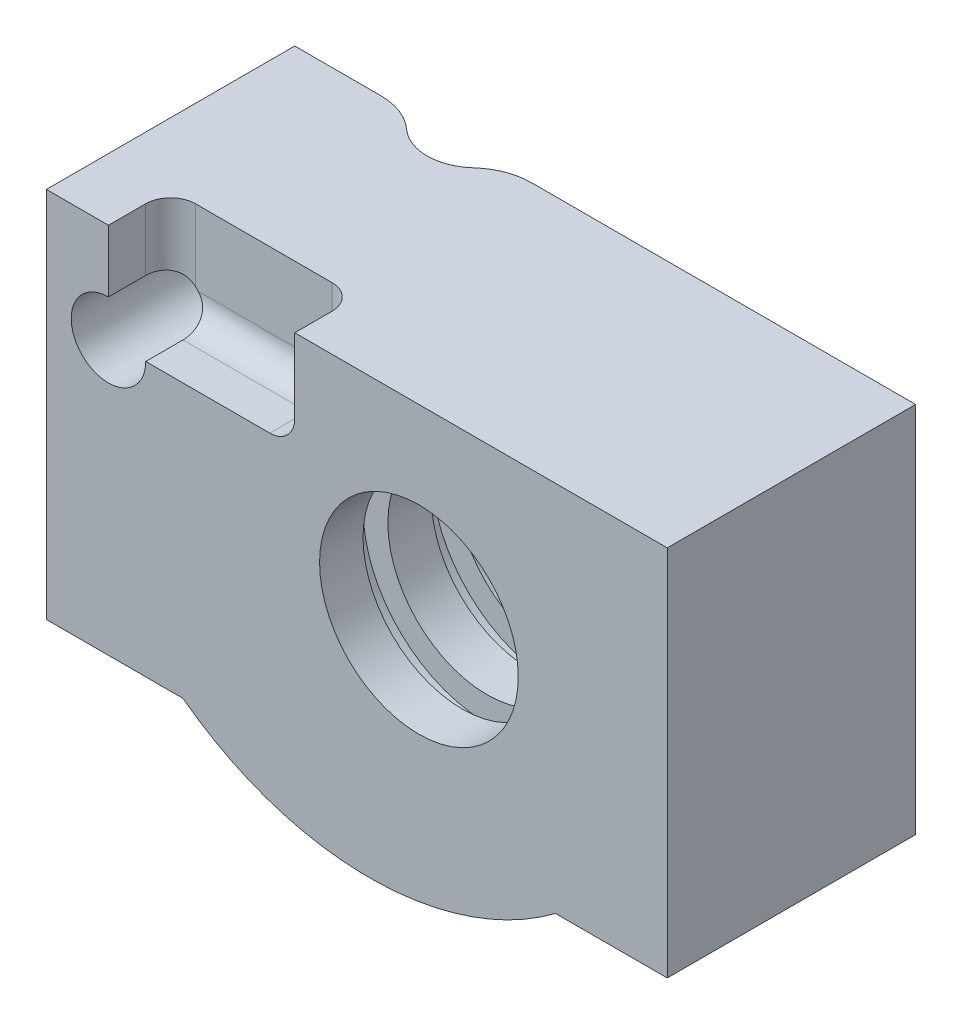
ISO-10303-21;
HEADER;
FILE_DESCRIPTION(('STEP AP214'),'2;1');
FILE_NAME('part.step','',(''),(''),'','','');
FILE_SCHEMA(('AUTOMOTIVE_DESIGN { 1 0 10303 214 1 1 1 1 }'));
ENDSEC;
DATA;
#1=APPLICATION_CONTEXT('core data for automotive mechanical design processes');
#2=APPLICATION_PROTOCOL_DEFINITION('international standard','automotive_design',2000,#1);
#3=PRODUCT_CONTEXT('',#1,'mechanical');
#4=PRODUCT('Part','Part','',(#3));
#5=PRODUCT_RELATED_PRODUCT_CATEGORY('part','',(#4));
#6=PRODUCT_DEFINITION_FORMATION('','',#4);
#7=PRODUCT_DEFINITION_CONTEXT('part definition',#1,'design');
#8=PRODUCT_DEFINITION('design','',#6,#7);
#9=PRODUCT_DEFINITION_SHAPE('','',#8);
#10=(LENGTH_UNIT() NAMED_UNIT(*) SI_UNIT(.MILLI.,.METRE.));
#11=(NAMED_UNIT(*) PLANE_ANGLE_UNIT() SI_UNIT($,.RADIAN.));
#12=(NAMED_UNIT(*) SI_UNIT($,.STERADIAN.) SOLID_ANGLE_UNIT());
#13=UNCERTAINTY_MEASURE_WITH_UNIT(LENGTH_MEASURE(1.E-05),#10,'distance_accuracy_value','');
#14=(GEOMETRIC_REPRESENTATION_CONTEXT(3) GLOBAL_UNCERTAINTY_ASSIGNED_CONTEXT((#13)) GLOBAL_UNIT_ASSIGNED_CONTEXT((#10,
#11,#12)) REPRESENTATION_CONTEXT('',''));
#15=CARTESIAN_POINT('',(0.,0.,0.));
#16=DIRECTION('',(0.,0.,1.));
#17=DIRECTION('',(1.,0.,0.));
#18=AXIS2_PLACEMENT_3D('',#15,#16,#17);
#19=CARTESIAN_POINT('',(-15.,-3.,0.));
#20=DIRECTION('',(0.,0.,1.));
#21=DIRECTION('',(1.,0.,0.));
#22=AXIS2_PLACEMENT_3D('',#19,#20,#21);
#23=CYLINDRICAL_SURFACE('',#22,2.73470224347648);
#24=CARTESIAN_POINT('',(-14.3097315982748,-0.353846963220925,1.29981927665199));
#25=CARTESIAN_POINT('',(-14.2525353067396,-0.368760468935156,1.24781669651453));
#26=CARTESIAN_POINT('',(-14.1944120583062,-0.385909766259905,1.19743520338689));
#27=CARTESIAN_POINT('',(-14.076859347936,-0.425074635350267,1.10011331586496));
#28=CARTESIAN_POINT('',(-14.0174288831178,-0.44709406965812,1.05317569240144));
#29=CARTESIAN_POINT('',(-13.8977510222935,-0.496433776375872,0.962909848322));
#30=CARTESIAN_POINT('',(-13.8375019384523,-0.523767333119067,0.919591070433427));
#31=CARTESIAN_POINT('',(-13.7170788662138,-0.58396219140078,0.836898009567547));
#32=CARTESIAN_POINT('',(-13.6569048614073,-0.616821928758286,0.797522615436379));
#33=CARTESIAN_POINT('',(-13.5370757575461,-0.688431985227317,0.722618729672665));
#34=CARTESIAN_POINT('',(-13.4774254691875,-0.727214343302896,0.687113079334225));
#35=CARTESIAN_POINT('',(-13.3598545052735,-0.810545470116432,0.620250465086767));
#36=CARTESIAN_POINT('',(-13.3019337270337,-0.855093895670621,0.588893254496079));
#37=CARTESIAN_POINT('',(-13.18880539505,-0.949733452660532,0.530336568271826));
#38=CARTESIAN_POINT('',(-13.1335922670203,-0.999812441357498,0.503128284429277));
#39=CARTESIAN_POINT('',(-13.0265936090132,-1.10529180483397,0.452653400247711));
#40=CARTESIAN_POINT('',(-12.9748077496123,-1.16069166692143,0.429386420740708));
#41=CARTESIAN_POINT('',(-12.8344798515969,-1.32416998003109,0.368935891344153));
#42=CARTESIAN_POINT('',(-12.7507455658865,-1.43809325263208,0.336049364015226));
#43=CARTESIAN_POINT('',(-12.6010621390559,-1.67942623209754,0.280873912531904));
#44=CARTESIAN_POINT('',(-12.535127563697,-1.80684686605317,0.2585936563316));
#45=CARTESIAN_POINT('',(-12.4241609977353,-2.07050977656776,0.222859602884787));
#46=CARTESIAN_POINT('',(-12.3789786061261,-2.20668015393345,0.20934199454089));
#47=CARTESIAN_POINT('',(-12.3104350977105,-2.4848632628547,0.189382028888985));
#48=CARTESIAN_POINT('',(-12.2870707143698,-2.6268751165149,0.182938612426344));
#49=CARTESIAN_POINT('',(-12.2626192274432,-2.91648713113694,0.176200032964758));
#50=CARTESIAN_POINT('',(-12.2620956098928,-3.06413874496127,0.17606038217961));
#51=CARTESIAN_POINT('',(-12.2847754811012,-3.35748969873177,0.182302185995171));
#52=CARTESIAN_POINT('',(-12.3079824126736,-3.5031887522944,0.188684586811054));
#53=CARTESIAN_POINT('',(-12.3775659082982,-3.78947891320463,0.208914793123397));
#54=CARTESIAN_POINT('',(-12.4240989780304,-3.93002854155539,0.22281307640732));
#55=CARTESIAN_POINT('',(-12.5386456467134,-4.20080315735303,0.259753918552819));
#56=CARTESIAN_POINT('',(-12.6066570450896,-4.33102920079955,0.282795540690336));
#57=CARTESIAN_POINT('',(-12.7599982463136,-4.57525843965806,0.339612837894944));
#58=CARTESIAN_POINT('',(-12.8450321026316,-4.68948875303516,0.373210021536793));
#59=CARTESIAN_POINT('',(-13.029039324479,-4.90092889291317,0.453056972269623));
#60=CARTESIAN_POINT('',(-13.128003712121,-4.9981495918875,0.499298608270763));
#61=CARTESIAN_POINT('',(-13.332630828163,-5.17165682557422,0.604412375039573));
#62=CARTESIAN_POINT('',(-13.4380995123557,-5.2483550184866,0.662985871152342));
#63=CARTESIAN_POINT('',(-13.6526986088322,-5.38315984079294,0.793529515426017));
#64=CARTESIAN_POINT('',(-13.761832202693,-5.44124982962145,0.865511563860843));
#65=CARTESIAN_POINT('',(-13.9450508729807,-5.52436763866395,0.997554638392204));
#66=CARTESIAN_POINT('',(-14.0194593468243,-5.55405727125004,1.05433974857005));
#67=CARTESIAN_POINT('',(-14.1662950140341,-5.60568092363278,1.17319528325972));
#68=CARTESIAN_POINT('',(-14.2387280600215,-5.62764084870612,1.23524717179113));
#69=CARTESIAN_POINT('',(-14.3097315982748,-5.64615303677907,1.29981927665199));
#70=B_SPLINE_CURVE_WITH_KNOTS('',3,(#24,#25,#26,#27,#28,#29,#30,#31,#32,#33,#34,#35,#36,#37,#38,
#39,#40,#41,#42,#43,#44,#45,#46,#47,#48,#49,#50,#51,#52,#53,#54,#55,#56,#57,#58,#59,#60,#61,#62,
#63,#64,#65,#66,#67,#68,#69),.UNSPECIFIED.,.F.,.F.,(4,2,2,2,2,2,2,2,2,2,2,2,2,2,2,2,2,2,2,2,2,2,
4),(0.,0.236170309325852,0.472528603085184,0.709485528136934,0.946375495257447,1.18459557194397,
1.4228014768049,1.66049440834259,1.89816445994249,2.33134880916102,2.7648865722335,
3.19523067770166,3.62551034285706,4.06639923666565,4.50735210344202,4.95130393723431,
5.39521030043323,5.83198135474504,6.26847219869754,6.69540839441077,7.12272532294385,
7.41687160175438,7.71002247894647),.UNSPECIFIED.);
#71=CARTESIAN_POINT('',(-14.3097315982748,-0.353846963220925,1.29981927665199));
#72=VERTEX_POINT('',#71);
#73=CARTESIAN_POINT('',(-14.3097315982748,-5.64615303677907,1.29981927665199));
#74=VERTEX_POINT('',#73);
#75=EDGE_CURVE('E46',#72,#74,#70,.T.);
#76=ORIENTED_EDGE('',*,*,#75,.T.);
#77=CARTESIAN_POINT('',(-14.3097315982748,-0.353846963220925,1.29981927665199));
#78=CARTESIAN_POINT('',(-14.3670238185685,-0.338899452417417,1.35189784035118));
#79=CARTESIAN_POINT('',(-14.4260795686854,-0.325484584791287,1.40252226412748));
#80=CARTESIAN_POINT('',(-14.5475407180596,-0.302278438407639,1.50061271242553));
#81=CARTESIAN_POINT('',(-14.6099497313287,-0.292491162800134,1.54807520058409));
#82=CARTESIAN_POINT('',(-14.7382636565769,-0.277079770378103,1.63979796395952));
#83=CARTESIAN_POINT('',(-14.8041901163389,-0.271485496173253,1.68403329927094));
#84=CARTESIAN_POINT('',(-14.9387163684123,-0.265155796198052,1.76858375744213));
#85=CARTESIAN_POINT('',(-15.0073152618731,-0.264418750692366,1.80890018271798));
#86=CARTESIAN_POINT('',(-15.1472146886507,-0.26836018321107,1.8856014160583));
#87=CARTESIAN_POINT('',(-15.218531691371,-0.273079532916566,1.92195429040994));
#88=CARTESIAN_POINT('',(-15.362683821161,-0.288485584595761,1.99009257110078));
#89=CARTESIAN_POINT('',(-15.4355187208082,-0.299171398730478,2.02187865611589));
#90=CARTESIAN_POINT('',(-15.581631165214,-0.326836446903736,2.08058365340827));
#91=CARTESIAN_POINT('',(-15.6549059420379,-0.343791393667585,2.10752076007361));
#92=CARTESIAN_POINT('',(-15.8012337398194,-0.384203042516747,2.1566011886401));
#93=CARTESIAN_POINT('',(-15.8742867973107,-0.407658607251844,2.17874534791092));
#94=CARTESIAN_POINT('',(-16.0719221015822,-0.480615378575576,2.23267052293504));
#95=CARTESIAN_POINT('',(-16.1954508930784,-0.536668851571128,2.2597931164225));
#96=CARTESIAN_POINT('',(-16.4343972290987,-0.667678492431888,2.30135074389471));
#97=CARTESIAN_POINT('',(-16.5498061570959,-0.742654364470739,2.31577248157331));
#98=CARTESIAN_POINT('',(-16.7652483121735,-0.907079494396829,2.33420169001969));
#99=CARTESIAN_POINT('',(-16.8656354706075,-0.996034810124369,2.33850470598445));
#100=CARTESIAN_POINT('',(-17.052307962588,-1.18767056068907,2.34042384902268));
#101=CARTESIAN_POINT('',(-17.138593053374,-1.29035123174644,2.33803986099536));
#102=CARTESIAN_POINT('',(-17.3018640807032,-1.51639719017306,2.32917815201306));
#103=CARTESIAN_POINT('',(-17.377423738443,-1.64078044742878,2.32236777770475));
#104=CARTESIAN_POINT('',(-17.5078867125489,-1.89992549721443,2.30784480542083));
#105=CARTESIAN_POINT('',(-17.5627823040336,-2.03469114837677,2.30013187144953));
#106=CARTESIAN_POINT('',(-17.653119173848,-2.31945723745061,2.28627724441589));
#107=CARTESIAN_POINT('',(-17.6872327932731,-2.46988767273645,2.28025402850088));
#108=CARTESIAN_POINT('',(-17.7297161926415,-2.7744344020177,2.27261145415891));
#109=CARTESIAN_POINT('',(-17.7380900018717,-2.92855011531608,2.27099140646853));
#110=CARTESIAN_POINT('',(-17.7288914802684,-3.23424374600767,2.27270573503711));
#111=CARTESIAN_POINT('',(-17.7116082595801,-3.38583076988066,2.27598490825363));
#112=CARTESIAN_POINT('',(-17.6521593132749,-3.68392755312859,2.28626611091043));
#113=CARTESIAN_POINT('',(-17.6099885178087,-3.8304362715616,2.29326889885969));
#114=CARTESIAN_POINT('',(-17.5018278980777,-4.11474201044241,2.30844530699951));
#115=CARTESIAN_POINT('',(-17.4357767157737,-4.25251550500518,2.31662191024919));
#116=CARTESIAN_POINT('',(-17.2815973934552,-4.5152935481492,2.33049846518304));
#117=CARTESIAN_POINT('',(-17.1934659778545,-4.64029619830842,2.33619804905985));
#118=CARTESIAN_POINT('',(-16.9968725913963,-4.87473564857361,2.34088673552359));
#119=CARTESIAN_POINT('',(-16.8882856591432,-4.984069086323,2.33983320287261));
#120=CARTESIAN_POINT('',(-16.6546900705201,-5.18266926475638,2.32645108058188));
#121=CARTESIAN_POINT('',(-16.5296931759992,-5.27195025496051,2.314130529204));
#122=CARTESIAN_POINT('',(-16.2779209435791,-5.42185541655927,2.27586437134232));
#123=CARTESIAN_POINT('',(-16.1519511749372,-5.48410322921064,2.2509864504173));
#124=CARTESIAN_POINT('',(-15.8954077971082,-5.58765255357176,2.18640349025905));
#125=CARTESIAN_POINT('',(-15.7648385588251,-5.62897340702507,2.14671220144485));
#126=CARTESIAN_POINT('',(-15.5132922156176,-5.6890003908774,2.05537025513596));
#127=CARTESIAN_POINT('',(-15.3922670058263,-5.70905410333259,2.00471723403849));
#128=CARTESIAN_POINT('',(-15.1543870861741,-5.73296343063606,1.89089172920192));
#129=CARTESIAN_POINT('',(-15.0375407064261,-5.73678830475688,1.82769572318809));
#130=CARTESIAN_POINT('',(-14.813734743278,-5.730594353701,1.69183596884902));
#131=CARTESIAN_POINT('',(-14.7066064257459,-5.72090162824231,1.61943224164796));
#132=CARTESIAN_POINT('',(-14.5525686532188,-5.69834871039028,1.50419421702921));
#133=CARTESIAN_POINT('',(-14.5024275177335,-5.68952157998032,1.46476339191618));
#134=CARTESIAN_POINT('',(-14.4043866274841,-5.66952032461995,1.38382079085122));
#135=CARTESIAN_POINT('',(-14.3564856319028,-5.65834751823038,1.34231019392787));
#136=CARTESIAN_POINT('',(-14.3097315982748,-5.64615303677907,1.29981927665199));
#137=B_SPLINE_CURVE_WITH_KNOTS('',3,(#77,#78,#79,#80,#81,#82,#83,#84,#85,#86,#87,#88,#89,#90,
#91,#92,#93,#94,#95,#96,#97,#98,#99,#100,#101,#102,#103,#104,#105,#106,#107,#108,#109,#110,#111,
#112,#113,#114,#115,#116,#117,#118,#119,#120,#121,#122,#123,#124,#125,#126,#127,#128,#129,#130,
#131,#132,#133,#134,#135,#136),.UNSPECIFIED.,.F.,.F.,(4,2,2,2,2,2,2,2,2,2,2,2,2,2,2,2,2,2,2,2,2,
2,2,2,2,2,2,2,2,4),(0.,0.236560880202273,0.473382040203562,0.711873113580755,0.950284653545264,
1.19049367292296,1.43066695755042,1.66991937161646,1.90912995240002,2.32182800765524,
2.73495759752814,3.13586206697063,3.53677343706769,3.97196998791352,4.40732906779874,
4.86818550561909,5.32896979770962,5.78460110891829,6.24032526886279,6.69722878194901,
7.15420011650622,7.61405933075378,8.07359072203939,8.49935592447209,8.92472689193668,
9.32115139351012,9.71832646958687,10.106084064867,10.2991756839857,10.4921590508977),.UNSPECIFIED.);
#138=EDGE_CURVE('E52',#72,#74,#137,.T.);
#139=ORIENTED_EDGE('',*,*,#138,.F.);
#140=EDGE_LOOP('',(#76,#139));
#141=FACE_BOUND('',#140,.T.);
#142=CARTESIAN_POINT('',(-15.,-3.,4.56643195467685));
#143=DIRECTION('',(0.,0.,1.));
#144=DIRECTION('',(1.,0.,0.));
#145=AXIS2_PLACEMENT_3D('',#142,#143,#144);
#146=CIRCLE('',#145,2.73470224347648);
#147=CARTESIAN_POINT('',(-12.2652977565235,-3.,4.56643195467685));
#148=VERTEX_POINT('',#147);
#149=EDGE_CURVE('E11',#148,#148,#146,.F.);
#150=ORIENTED_EDGE('',*,*,#149,.F.);
#151=EDGE_LOOP('',(#150));
#152=FACE_BOUND('',#151,.T.);
#153=ADVANCED_FACE('F37',(#141,#152),#23,.F.);
#154=CARTESIAN_POINT('',(0.,0.,0.));
#155=DIRECTION('',(0.,0.,-1.));
#156=DIRECTION('',(-1.,0.,0.));
#157=AXIS2_PLACEMENT_3D('',#154,#155,#156);
#158=CYLINDRICAL_SURFACE('',#157,10.);
#159=CARTESIAN_POINT('',(0.,0.,14.5));
#160=DIRECTION('',(0.,0.,-1.));
#161=DIRECTION('',(-1.,0.,0.));
#162=AXIS2_PLACEMENT_3D('',#159,#160,#161);
#163=CIRCLE('',#162,10.);
#164=CARTESIAN_POINT('',(-10.,0.,14.5));
#165=VERTEX_POINT('',#164);
#166=EDGE_CURVE('E366',#165,#165,#163,.T.);
#167=ORIENTED_EDGE('',*,*,#166,.T.);
#168=EDGE_LOOP('',(#167));
#169=FACE_BOUND('',#168,.T.);
#170=CARTESIAN_POINT('',(0.,0.,16.5));
#171=DIRECTION('',(0.,0.,-1.));
#172=DIRECTION('',(-1.,0.,0.));
#173=AXIS2_PLACEMENT_3D('',#170,#171,#172);
#174=CIRCLE('',#173,10.);
#175=CARTESIAN_POINT('',(-10.,0.,16.5));
#176=VERTEX_POINT('',#175);
#177=EDGE_CURVE('E369',#176,#176,#174,.T.);
#178=ORIENTED_EDGE('',*,*,#177,.F.);
#179=EDGE_LOOP('',(#178));
#180=FACE_BOUND('',#179,.T.);
#181=CARTESIAN_POINT('',(0.,0.,16.));
#182=DIRECTION('',(0.,0.,-1.));
#183=DIRECTION('',(-1.,0.,0.));
#184=AXIS2_PLACEMENT_3D('',#181,#182,#183);
#185=CIRCLE('',#184,10.);
#186=CARTESIAN_POINT('',(3.65612152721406,9.30767293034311,16.));
#187=VERTEX_POINT('',#186);
#188=CARTESIAN_POINT('',(-3.65612152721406,9.30767293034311,16.));
#189=VERTEX_POINT('',#188);
#190=EDGE_CURVE('E481',#187,#189,#185,.F.);
#191=ORIENTED_EDGE('',*,*,#190,.F.);
#192=DIRECTION('',(0.,0.,-1.));
#193=VECTOR('',#192,1.);
#194=CARTESIAN_POINT('',(3.65612152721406,9.30767293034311,0.));
#195=LINE('',#194,#193);
#196=CARTESIAN_POINT('',(3.65612152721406,9.30767293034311,15.));
#197=VERTEX_POINT('',#196);
#198=EDGE_CURVE('E478',#197,#187,#195,.F.);
#199=ORIENTED_EDGE('',*,*,#198,.F.);
#200=CARTESIAN_POINT('',(0.,0.,15.));
#201=DIRECTION('',(0.,0.,1.));
#202=DIRECTION('',(1.,0.,0.));
#203=AXIS2_PLACEMENT_3D('',#200,#201,#202);
#204=CIRCLE('',#203,10.);
#205=CARTESIAN_POINT('',(-3.65612152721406,9.30767293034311,15.));
#206=VERTEX_POINT('',#205);
#207=EDGE_CURVE('E471',#206,#197,#204,.F.);
#208=ORIENTED_EDGE('',*,*,#207,.F.);
#209=DIRECTION('',(0.,0.,-1.));
#210=VECTOR('',#209,1.);
#211=CARTESIAN_POINT('',(-3.65612152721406,9.30767293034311,0.));
#212=LINE('',#211,#210);
#213=EDGE_CURVE('E473',#189,#206,#212,.T.);
#214=ORIENTED_EDGE('',*,*,#213,.F.);
#215=EDGE_LOOP('',(#191,#199,#208,#214));
#216=FACE_BOUND('',#215,.T.);
#217=ADVANCED_FACE('F267',(#169,#180,#216),#158,.F.);
#218=CARTESIAN_POINT('',(-4.,5.,0.));
#219=DIRECTION('',(0.,0.,1.));
#220=DIRECTION('',(1.,0.,0.));
#221=AXIS2_PLACEMENT_3D('',#218,#219,#220);
#222=PLANE('',#221);
#223=CARTESIAN_POINT('',(0.,0.,0.));
#224=DIRECTION('',(0.,0.,-1.));
#225=DIRECTION('',(-1.,0.,0.));
#226=AXIS2_PLACEMENT_3D('',#223,#224,#225);
#227=CIRCLE('',#226,8.);
#228=CARTESIAN_POINT('',(-8.,0.,0.));
#229=VERTEX_POINT('',#228);
#230=EDGE_CURVE('E336',#229,#229,#227,.T.);
#231=ORIENTED_EDGE('',*,*,#230,.F.);
#232=EDGE_LOOP('',(#231));
#233=FACE_BOUND('',#232,.T.);
#234=CARTESIAN_POINT('',(-4.,5.,0.));
#235=DIRECTION('',(0.,0.,1.));
#236=DIRECTION('',(1.,0.,0.));
#237=AXIS2_PLACEMENT_3D('',#234,#235,#236);
#238=CIRCLE('',#237,25.);
#239=CARTESIAN_POINT('',(-10.9468960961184,-19.0154249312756,0.));
#240=VERTEX_POINT('',#239);
#241=CARTESIAN_POINT('',(11.,-15.,0.));
#242=VERTEX_POINT('',#241);
#243=EDGE_CURVE('E418',#240,#242,#238,.T.);
#244=ORIENTED_EDGE('',*,*,#243,.F.);
#245=DIRECTION('',(0.,1.,0.));
#246=VECTOR('',#245,1.);
#247=CARTESIAN_POINT('',(-10.9468960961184,5.,0.));
#248=LINE('',#247,#246);
#249=CARTESIAN_POINT('',(-10.9468960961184,15.,0.));
#250=VERTEX_POINT('',#249);
#251=EDGE_CURVE('E395',#240,#250,#248,.T.);
#252=ORIENTED_EDGE('',*,*,#251,.T.);
#253=DIRECTION('',(-1.,0.,0.));
#254=VECTOR('',#253,1.);
#255=CARTESIAN_POINT('',(-30.,15.,0.));
#256=LINE('',#255,#254);
#257=CARTESIAN_POINT('',(20.,15.,0.));
#258=VERTEX_POINT('',#257);
#259=EDGE_CURVE('E412',#258,#250,#256,.T.);
#260=ORIENTED_EDGE('',*,*,#259,.F.);
#261=DIRECTION('',(0.,1.,0.));
#262=VECTOR('',#261,1.);
#263=CARTESIAN_POINT('',(20.,15.,0.));
#264=LINE('',#263,#262);
#265=CARTESIAN_POINT('',(20.,-15.,0.));
#266=VERTEX_POINT('',#265);
#267=EDGE_CURVE('E422',#266,#258,#264,.T.);
#268=ORIENTED_EDGE('',*,*,#267,.F.);
#269=DIRECTION('',(1.,0.,0.));
#270=VECTOR('',#269,1.);
#271=CARTESIAN_POINT('',(11.,-15.,0.));
#272=LINE('',#271,#270);
#273=EDGE_CURVE('E419',#242,#266,#272,.T.);
#274=ORIENTED_EDGE('',*,*,#273,.F.);
#275=EDGE_LOOP('',(#244,#252,#260,#268,#274));
#276=FACE_BOUND('',#275,.T.);
#277=ADVANCED_FACE('F415',(#233,#276),#222,.F.);
#278=CARTESIAN_POINT('',(-30.,15.,20.));
#279=DIRECTION('',(1.,0.,0.));
#280=DIRECTION('',(0.,1.,0.));
#281=AXIS2_PLACEMENT_3D('',#278,#279,#280);
#282=PLANE('',#281);
#283=DIRECTION('',(0.,-1.,0.));
#284=VECTOR('',#283,1.);
#285=CARTESIAN_POINT('',(-30.,15.,0.));
#286=LINE('',#285,#284);
#287=CARTESIAN_POINT('',(-30.,15.,0.));
#288=VERTEX_POINT('',#287);
#289=CARTESIAN_POINT('',(-30.,-15.,0.));
#290=VERTEX_POINT('',#289);
#291=EDGE_CURVE('E242',#288,#290,#286,.T.);
#292=ORIENTED_EDGE('',*,*,#291,.T.);
#293=DIRECTION('',(0.,0.,-1.));
#294=VECTOR('',#293,1.);
#295=CARTESIAN_POINT('',(-30.,-15.,20.));
#296=LINE('',#295,#294);
#297=CARTESIAN_POINT('',(-30.,-15.,20.));
#298=VERTEX_POINT('',#297);
#299=EDGE_CURVE('E391',#298,#290,#296,.T.);
#300=ORIENTED_EDGE('',*,*,#299,.F.);
#301=DIRECTION('',(0.,-1.,0.));
#302=VECTOR('',#301,1.);
#303=CARTESIAN_POINT('',(-30.,15.,20.));
#304=LINE('',#303,#302);
#305=CARTESIAN_POINT('',(-30.,15.,20.));
#306=VERTEX_POINT('',#305);
#307=EDGE_CURVE('E245',#306,#298,#304,.T.);
#308=ORIENTED_EDGE('',*,*,#307,.F.);
#309=DIRECTION('',(0.,0.,-1.));
#310=VECTOR('',#309,1.);
#311=CARTESIAN_POINT('',(-30.,15.,20.));
#312=LINE('',#311,#310);
#313=EDGE_CURVE('E430',#306,#288,#312,.T.);
#314=ORIENTED_EDGE('',*,*,#313,.T.);
#315=EDGE_LOOP('',(#292,#300,#308,#314));
#316=FACE_BOUND('',#315,.T.);
#317=ADVANCED_FACE('F457',(#316),#282,.F.);
#318=CARTESIAN_POINT('',(-30.,-15.,20.));
#319=DIRECTION('',(0.,1.,0.));
#320=DIRECTION('',(0.,0.,1.));
#321=AXIS2_PLACEMENT_3D('',#318,#319,#320);
#322=PLANE('',#321);
#323=DIRECTION('',(1.,0.,0.));
#324=VECTOR('',#323,1.);
#325=CARTESIAN_POINT('',(-30.,-15.,0.));
#326=LINE('',#325,#324);
#327=CARTESIAN_POINT('',(-23.0531039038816,-15.,0.));
#328=VERTEX_POINT('',#327);
#329=EDGE_CURVE('E420',#290,#328,#326,.T.);
#330=ORIENTED_EDGE('',*,*,#329,.T.);
#331=CARTESIAN_POINT('',(-23.0531039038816,-15.,5.));
#332=DIRECTION('',(0.,1.,0.));
#333=DIRECTION('',(0.,0.,1.));
#334=AXIS2_PLACEMENT_3D('',#331,#332,#333);
#335=CIRCLE('',#334,5.);
#336=CARTESIAN_POINT('',(-19.6902684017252,-15.,1.29981927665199));
#337=VERTEX_POINT('',#336);
#338=EDGE_CURVE('E387',#328,#337,#335,.F.);
#339=ORIENTED_EDGE('',*,*,#338,.T.);
#340=CARTESIAN_POINT('',(-17.,-15.,-1.66032530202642));
#341=DIRECTION('',(0.,1.,0.));
#342=DIRECTION('',(0.,0.,1.));
#343=AXIS2_PLACEMENT_3D('',#340,#341,#342);
#344=CIRCLE('',#343,4.);
#345=CARTESIAN_POINT('',(-19.,-15.,1.80377631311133));
#346=VERTEX_POINT('',#345);
#347=EDGE_CURVE('E243',#337,#346,#344,.T.);
#348=ORIENTED_EDGE('',*,*,#347,.T.);
#349=DIRECTION('',(0.,0.,-1.));
#350=VECTOR('',#349,1.);
#351=CARTESIAN_POINT('',(-19.,-15.,20.));
#352=LINE('',#351,#350);
#353=CARTESIAN_POINT('',(-19.,-15.,20.));
#354=VERTEX_POINT('',#353);
#355=EDGE_CURVE('E384',#354,#346,#352,.T.);
#356=ORIENTED_EDGE('',*,*,#355,.F.);
#357=DIRECTION('',(1.,0.,0.));
#358=VECTOR('',#357,1.);
#359=CARTESIAN_POINT('',(-30.,-15.,20.));
#360=LINE('',#359,#358);
#361=EDGE_CURVE('E449',#298,#354,#360,.T.);
#362=ORIENTED_EDGE('',*,*,#361,.F.);
#363=ORIENTED_EDGE('',*,*,#299,.T.);
#364=EDGE_LOOP('',(#330,#339,#348,#356,#362,#363));
#365=FACE_BOUND('',#364,.T.);
#366=ADVANCED_FACE('F230',(#365),#322,.F.);
#367=CARTESIAN_POINT('',(-4.,5.,20.));
#368=DIRECTION('',(0.,0.,-1.));
#369=DIRECTION('',(-1.,0.,0.));
#370=AXIS2_PLACEMENT_3D('',#367,#368,#369);
#371=CYLINDRICAL_SURFACE('',#370,25.);
#372=CARTESIAN_POINT('',(-19.,-15.,1.80377631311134));
#373=CARTESIAN_POINT('',(-18.8766514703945,-15.092531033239,1.87496960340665));
#374=CARTESIAN_POINT('',(-18.7499284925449,-15.1857713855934,1.93937151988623));
#375=CARTESIAN_POINT('',(-18.4905979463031,-15.3727248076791,2.05427814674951));
#376=CARTESIAN_POINT('',(-18.3579886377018,-15.4664380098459,2.10477871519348));
#377=CARTESIAN_POINT('',(-18.0871607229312,-15.6537939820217,2.191738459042));
#378=CARTESIAN_POINT('',(-17.9489177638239,-15.7474341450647,2.22812744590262));
#379=CARTESIAN_POINT('',(-17.6684245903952,-15.9332856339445,2.28602914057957));
#380=CARTESIAN_POINT('',(-17.5261748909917,-16.0254971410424,2.30754375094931));
#381=CARTESIAN_POINT('',(-17.2473858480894,-16.2021780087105,2.33432278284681));
#382=CARTESIAN_POINT('',(-17.1110167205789,-16.2867797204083,2.3404856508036));
#383=CARTESIAN_POINT('',(-16.836738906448,-16.4532948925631,2.33869315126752));
#384=CARTESIAN_POINT('',(-16.6988303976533,-16.5352086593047,2.33073939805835));
#385=CARTESIAN_POINT('',(-16.4229333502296,-16.6955325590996,2.30025769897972));
#386=CARTESIAN_POINT('',(-16.2849454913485,-16.7739492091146,2.27775818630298));
#387=CARTESIAN_POINT('',(-16.010012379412,-16.926794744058,2.21778154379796));
#388=CARTESIAN_POINT('',(-15.873066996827,-17.0012241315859,2.18030630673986));
#389=CARTESIAN_POINT('',(-15.6141808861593,-17.1388866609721,2.09418933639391));
#390=CARTESIAN_POINT('',(-15.4920111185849,-17.202521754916,2.0468783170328));
#391=CARTESIAN_POINT('',(-15.2511730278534,-17.3255320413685,1.93953276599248));
#392=CARTESIAN_POINT('',(-15.1325040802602,-17.3849079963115,1.87950051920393));
#393=CARTESIAN_POINT('',(-14.9000796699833,-17.4990006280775,1.74676245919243));
#394=CARTESIAN_POINT('',(-14.7863247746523,-17.5537167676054,1.67405518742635));
#395=CARTESIAN_POINT('',(-14.5652885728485,-17.6581025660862,1.5162466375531));
#396=CARTESIAN_POINT('',(-14.4580058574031,-17.7077733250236,1.43114807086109));
#397=CARTESIAN_POINT('',(-14.2657805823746,-17.7952476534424,1.26168046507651));
#398=CARTESIAN_POINT('',(-14.1798010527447,-17.8337422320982,1.1788403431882));
#399=CARTESIAN_POINT('',(-14.0148134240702,-17.9065851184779,1.00482544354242));
#400=CARTESIAN_POINT('',(-13.9358040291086,-17.9409341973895,0.913652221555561));
#401=CARTESIAN_POINT('',(-13.7859206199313,-18.0052688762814,0.72384790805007));
#402=CARTESIAN_POINT('',(-13.7150254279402,-18.0352658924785,0.625237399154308));
#403=CARTESIAN_POINT('',(-13.5820659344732,-18.0908900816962,0.421149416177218));
#404=CARTESIAN_POINT('',(-13.519994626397,-18.1165207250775,0.315677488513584));
#405=CARTESIAN_POINT('',(-13.4447966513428,-18.1472717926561,0.173253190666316));
#406=CARTESIAN_POINT('',(-13.4273235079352,-18.1543928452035,0.138971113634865));
#407=CARTESIAN_POINT('',(-13.3933587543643,-18.1681925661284,0.0698820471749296));
#408=CARTESIAN_POINT('',(-13.3768661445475,-18.1748716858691,0.035075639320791));
#409=CARTESIAN_POINT('',(-13.3608627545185,-18.1813340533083,0.));
#410=B_SPLINE_CURVE_WITH_KNOTS('',3,(#372,#373,#374,#375,#376,#377,#378,#379,#380,#381,#382,
#383,#384,#385,#386,#387,#388,#389,#390,#391,#392,#393,#394,#395,#396,#397,#398,#399,#400,#401,
#402,#403,#404,#405,#406,#407,#408,#409),.UNSPECIFIED.,.F.,.F.,(4,2,2,2,2,2,2,2,2,2,2,2,2,2,2,2,
2,2,4),(0.,0.509334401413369,1.01882039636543,1.53080894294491,2.04273198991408,
2.52390640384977,3.00502579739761,3.48520755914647,3.96532865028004,4.40164585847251,
4.83788476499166,5.27417390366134,5.71036771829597,6.08619501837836,6.46195229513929,
6.83670534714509,7.21115914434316,7.32854097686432,7.44580101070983),.UNSPECIFIED.);
#411=CARTESIAN_POINT('',(-14.3097315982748,-17.7751933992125,1.299819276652));
#412=VERTEX_POINT('',#411);
#413=EDGE_CURVE('E235',#346,#412,#410,.T.);
#414=ORIENTED_EDGE('',*,*,#413,.T.);
#415=CARTESIAN_POINT('',(-14.3097315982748,-17.7751933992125,1.29981927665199));
#416=CARTESIAN_POINT('',(-14.1978751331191,-17.8258366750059,1.19815632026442));
#417=CARTESIAN_POINT('',(-14.0816547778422,-17.8774454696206,1.10179760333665));
#418=CARTESIAN_POINT('',(-13.8413583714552,-17.9818343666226,0.920201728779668));
#419=CARTESIAN_POINT('',(-13.7172839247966,-18.0346142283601,0.834962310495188));
#420=CARTESIAN_POINT('',(-13.4657670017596,-18.1390857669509,0.678356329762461));
#421=CARTESIAN_POINT('',(-13.338523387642,-18.1907652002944,0.606661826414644));
#422=CARTESIAN_POINT('',(-13.0781893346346,-18.2939063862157,0.474639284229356));
#423=CARTESIAN_POINT('',(-12.9450989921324,-18.3453681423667,0.414311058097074));
#424=CARTESIAN_POINT('',(-12.6652657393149,-18.4507335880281,0.301984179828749));
#425=CARTESIAN_POINT('',(-12.5181924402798,-18.5045849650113,0.250757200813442));
#426=CARTESIAN_POINT('',(-12.2193957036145,-18.6107325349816,0.162125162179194));
#427=CARTESIAN_POINT('',(-12.0676723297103,-18.6630287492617,0.12471991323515));
#428=CARTESIAN_POINT('',(-11.7558575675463,-18.7670874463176,0.0632397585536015));
#429=CARTESIAN_POINT('',(-11.5956530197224,-18.8187815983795,0.0396203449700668));
#430=CARTESIAN_POINT('',(-11.2727716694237,-18.9193577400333,0.00798840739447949));
#431=CARTESIAN_POINT('',(-11.1100938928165,-18.9682385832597,-1.77976235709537E-05));
#432=CARTESIAN_POINT('',(-10.9468960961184,-19.0154249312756,0.));
#433=B_SPLINE_CURVE_WITH_KNOTS('',3,(#415,#416,#417,#418,#419,#420,#421,#422,#423,#424,#425,
#426,#427,#428,#429,#430,#431,#432),.UNSPECIFIED.,.F.,.F.,(4,2,2,2,2,2,2,2,4),(0.,
0.478065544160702,0.956033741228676,1.42028420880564,1.8845270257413,2.37823435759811,
2.87193492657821,3.381138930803,3.89054897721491),.UNSPECIFIED.);
#434=EDGE_CURVE('E205',#412,#240,#433,.T.);
#435=ORIENTED_EDGE('',*,*,#434,.T.);
#436=ORIENTED_EDGE('',*,*,#243,.T.);
#437=DIRECTION('',(0.,0.,-1.));
#438=VECTOR('',#437,1.);
#439=CARTESIAN_POINT('',(11.,-15.,20.));
#440=LINE('',#439,#438);
#441=CARTESIAN_POINT('',(11.,-15.,20.));
#442=VERTEX_POINT('',#441);
#443=EDGE_CURVE('E392',#442,#242,#440,.T.);
#444=ORIENTED_EDGE('',*,*,#443,.F.);
#445=CARTESIAN_POINT('',(-4.,5.,20.));
#446=DIRECTION('',(0.,0.,1.));
#447=DIRECTION('',(1.,0.,0.));
#448=AXIS2_PLACEMENT_3D('',#445,#446,#447);
#449=CIRCLE('',#448,25.);
#450=EDGE_CURVE('E390',#354,#442,#449,.T.);
#451=ORIENTED_EDGE('',*,*,#450,.F.);
#452=ORIENTED_EDGE('',*,*,#355,.T.);
#453=EDGE_LOOP('',(#414,#435,#436,#444,#451,#452));
#454=FACE_BOUND('',#453,.T.);
#455=ADVANCED_FACE('F224',(#454),#371,.T.);
#456=CARTESIAN_POINT('',(11.,-15.,20.));
#457=DIRECTION('',(0.,1.,0.));
#458=DIRECTION('',(0.,0.,1.));
#459=AXIS2_PLACEMENT_3D('',#456,#457,#458);
#460=PLANE('',#459);
#461=ORIENTED_EDGE('',*,*,#273,.T.);
#462=DIRECTION('',(0.,0.,-1.));
#463=VECTOR('',#462,1.);
#464=CARTESIAN_POINT('',(20.,-15.,20.));
#465=LINE('',#464,#463);
#466=CARTESIAN_POINT('',(20.,-15.,20.));
#467=VERTEX_POINT('',#466);
#468=EDGE_CURVE('E398',#467,#266,#465,.T.);
#469=ORIENTED_EDGE('',*,*,#468,.F.);
#470=DIRECTION('',(1.,0.,0.));
#471=VECTOR('',#470,1.);
#472=CARTESIAN_POINT('',(11.,-15.,20.));
#473=LINE('',#472,#471);
#474=EDGE_CURVE('E444',#442,#467,#473,.T.);
#475=ORIENTED_EDGE('',*,*,#474,.F.);
#476=ORIENTED_EDGE('',*,*,#443,.T.);
#477=EDGE_LOOP('',(#461,#469,#475,#476));
#478=FACE_BOUND('',#477,.T.);
#479=ADVANCED_FACE('F229',(#478),#460,.F.);
#480=CARTESIAN_POINT('',(20.,15.,20.));
#481=DIRECTION('',(-1.,0.,0.));
#482=DIRECTION('',(0.,-1.,0.));
#483=AXIS2_PLACEMENT_3D('',#480,#481,#482);
#484=PLANE('',#483);
#485=ORIENTED_EDGE('',*,*,#267,.T.);
#486=DIRECTION('',(0.,0.,-1.));
#487=VECTOR('',#486,1.);
#488=CARTESIAN_POINT('',(20.,15.,20.));
#489=LINE('',#488,#487);
#490=CARTESIAN_POINT('',(20.,15.,20.));
#491=VERTEX_POINT('',#490);
#492=EDGE_CURVE('E433',#491,#258,#489,.T.);
#493=ORIENTED_EDGE('',*,*,#492,.F.);
#494=DIRECTION('',(0.,1.,0.));
#495=VECTOR('',#494,1.);
#496=CARTESIAN_POINT('',(20.,15.,20.));
#497=LINE('',#496,#495);
#498=EDGE_CURVE('E441',#467,#491,#497,.T.);
#499=ORIENTED_EDGE('',*,*,#498,.F.);
#500=ORIENTED_EDGE('',*,*,#468,.T.);
#501=EDGE_LOOP('',(#485,#493,#499,#500));
#502=FACE_BOUND('',#501,.T.);
#503=ADVANCED_FACE('F439',(#502),#484,.F.);
#504=CARTESIAN_POINT('',(-30.,15.,20.));
#505=DIRECTION('',(0.,-1.,0.));
#506=DIRECTION('',(0.,0.,-1.));
#507=AXIS2_PLACEMENT_3D('',#504,#505,#506);
#508=PLANE('',#507);
#509=DIRECTION('',(-1.,0.,0.));
#510=VECTOR('',#509,1.);
#511=CARTESIAN_POINT('',(-30.,15.,20.));
#512=LINE('',#511,#510);
#513=CARTESIAN_POINT('',(-25.,15.,20.));
#514=VERTEX_POINT('',#513);
#515=EDGE_CURVE('E447',#514,#306,#512,.T.);
#516=ORIENTED_EDGE('',*,*,#515,.F.);
#517=DIRECTION('',(0.,0.,1.));
#518=VECTOR('',#517,1.);
#519=CARTESIAN_POINT('',(-25.,15.,15.));
#520=LINE('',#519,#518);
#521=CARTESIAN_POINT('',(-25.,15.,17.));
#522=VERTEX_POINT('',#521);
#523=EDGE_CURVE('E327',#522,#514,#520,.T.);
#524=ORIENTED_EDGE('',*,*,#523,.F.);
#525=CARTESIAN_POINT('',(-23.,15.,17.));
#526=DIRECTION('',(0.,-1.,0.));
#527=DIRECTION('',(0.,0.,-1.));
#528=AXIS2_PLACEMENT_3D('',#525,#526,#527);
#529=CIRCLE('',#528,2.);
#530=CARTESIAN_POINT('',(-23.,15.,15.));
#531=VERTEX_POINT('',#530);
#532=EDGE_CURVE('E504',#522,#531,#529,.T.);
#533=ORIENTED_EDGE('',*,*,#532,.T.);
#534=DIRECTION('',(-1.,0.,0.));
#535=VECTOR('',#534,1.);
#536=CARTESIAN_POINT('',(-25.,15.,15.));
#537=LINE('',#536,#535);
#538=CARTESIAN_POINT('',(-12.,15.,15.));
#539=VERTEX_POINT('',#538);
#540=EDGE_CURVE('E315',#539,#531,#537,.T.);
#541=ORIENTED_EDGE('',*,*,#540,.F.);
#542=CARTESIAN_POINT('',(-12.,15.,17.));
#543=DIRECTION('',(0.,-1.,0.));
#544=DIRECTION('',(0.,0.,-1.));
#545=AXIS2_PLACEMENT_3D('',#542,#543,#544);
#546=CIRCLE('',#545,2.);
#547=CARTESIAN_POINT('',(-10.,15.,17.));
#548=VERTEX_POINT('',#547);
#549=EDGE_CURVE('E282',#539,#548,#546,.T.);
#550=ORIENTED_EDGE('',*,*,#549,.T.);
#551=DIRECTION('',(0.,0.,1.));
#552=VECTOR('',#551,1.);
#553=CARTESIAN_POINT('',(-10.,15.,15.));
#554=LINE('',#553,#552);
#555=CARTESIAN_POINT('',(-10.,15.,20.));
#556=VERTEX_POINT('',#555);
#557=EDGE_CURVE('E318',#548,#556,#554,.T.);
#558=ORIENTED_EDGE('',*,*,#557,.T.);
#559=EDGE_CURVE('E434',#491,#556,#512,.T.);
#560=ORIENTED_EDGE('',*,*,#559,.F.);
#561=ORIENTED_EDGE('',*,*,#492,.T.);
#562=ORIENTED_EDGE('',*,*,#259,.T.);
#563=CARTESIAN_POINT('',(-10.9468960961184,15.,5.));
#564=DIRECTION('',(0.,-1.,0.));
#565=DIRECTION('',(0.,0.,-1.));
#566=AXIS2_PLACEMENT_3D('',#563,#564,#565);
#567=CIRCLE('',#566,5.);
#568=CARTESIAN_POINT('',(-14.3097315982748,15.,1.29981927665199));
#569=VERTEX_POINT('',#568);
#570=EDGE_CURVE('E208',#250,#569,#567,.F.);
#571=ORIENTED_EDGE('',*,*,#570,.T.);
#572=CARTESIAN_POINT('',(-17.,15.,-1.66032530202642));
#573=DIRECTION('',(0.,1.,0.));
#574=DIRECTION('',(0.,0.,1.));
#575=AXIS2_PLACEMENT_3D('',#572,#573,#574);
#576=CIRCLE('',#575,4.);
#577=CARTESIAN_POINT('',(-19.6902684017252,15.,1.29981927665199));
#578=VERTEX_POINT('',#577);
#579=EDGE_CURVE('E377',#578,#569,#576,.T.);
#580=ORIENTED_EDGE('',*,*,#579,.F.);
#581=CARTESIAN_POINT('',(-23.0531039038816,15.,5.));
#582=DIRECTION('',(0.,-1.,0.));
#583=DIRECTION('',(0.,0.,-1.));
#584=AXIS2_PLACEMENT_3D('',#581,#582,#583);
#585=CIRCLE('',#584,5.);
#586=CARTESIAN_POINT('',(-23.0531039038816,15.,0.));
#587=VERTEX_POINT('',#586);
#588=EDGE_CURVE('E404',#578,#587,#585,.F.);
#589=ORIENTED_EDGE('',*,*,#588,.T.);
#590=EDGE_CURVE('E428',#587,#288,#256,.T.);
#591=ORIENTED_EDGE('',*,*,#590,.T.);
#592=ORIENTED_EDGE('',*,*,#313,.F.);
#593=EDGE_LOOP('',(#516,#524,#533,#541,#550,#558,#560,#561,#562,#571,#580,#589,#591,#592));
#594=FACE_BOUND('',#593,.T.);
#595=ADVANCED_FACE('F408',(#594),#508,.F.);
#596=CARTESIAN_POINT('',(-4.,5.,20.));
#597=DIRECTION('',(0.,0.,1.));
#598=DIRECTION('',(1.,0.,0.));
#599=AXIS2_PLACEMENT_3D('',#596,#597,#598);
#600=PLANE('',#599);
#601=CARTESIAN_POINT('',(-12.,9.,20.));
#602=DIRECTION('',(0.,0.,1.));
#603=DIRECTION('',(1.,0.,0.));
#604=AXIS2_PLACEMENT_3D('',#601,#602,#603);
#605=CIRCLE('',#604,2.);
#606=CARTESIAN_POINT('',(-10.,9.,20.));
#607=VERTEX_POINT('',#606);
#608=CARTESIAN_POINT('',(-12.,7.,20.));
#609=VERTEX_POINT('',#608);
#610=EDGE_CURVE('E502',#607,#609,#605,.F.);
#611=ORIENTED_EDGE('',*,*,#610,.T.);
#612=DIRECTION('',(1.,0.,0.));
#613=VECTOR('',#612,1.);
#614=CARTESIAN_POINT('',(-25.,7.,20.));
#615=LINE('',#614,#613);
#616=CARTESIAN_POINT('',(-22.,7.,20.));
#617=VERTEX_POINT('',#616);
#618=EDGE_CURVE('E323',#617,#609,#615,.T.);
#619=ORIENTED_EDGE('',*,*,#618,.F.);
#620=CARTESIAN_POINT('',(-25.,7.,20.));
#621=DIRECTION('',(0.,0.,1.));
#622=DIRECTION('',(1.,0.,0.));
#623=AXIS2_PLACEMENT_3D('',#620,#621,#622);
#624=CIRCLE('',#623,3.);
#625=CARTESIAN_POINT('',(-25.,10.,20.));
#626=VERTEX_POINT('',#625);
#627=EDGE_CURVE('E200',#626,#617,#624,.T.);
#628=ORIENTED_EDGE('',*,*,#627,.F.);
#629=DIRECTION('',(0.,-1.,0.));
#630=VECTOR('',#629,1.);
#631=CARTESIAN_POINT('',(-25.,15.,20.));
#632=LINE('',#631,#630);
#633=EDGE_CURVE('E320',#514,#626,#632,.T.);
#634=ORIENTED_EDGE('',*,*,#633,.F.);
#635=ORIENTED_EDGE('',*,*,#515,.T.);
#636=ORIENTED_EDGE('',*,*,#307,.T.);
#637=ORIENTED_EDGE('',*,*,#361,.T.);
#638=ORIENTED_EDGE('',*,*,#450,.T.);
#639=ORIENTED_EDGE('',*,*,#474,.T.);
#640=ORIENTED_EDGE('',*,*,#498,.T.);
#641=ORIENTED_EDGE('',*,*,#559,.T.);
#642=DIRECTION('',(0.,1.,0.));
#643=VECTOR('',#642,1.);
#644=CARTESIAN_POINT('',(-10.,15.,20.));
#645=LINE('',#644,#643);
#646=EDGE_CURVE('E319',#607,#556,#645,.T.);
#647=ORIENTED_EDGE('',*,*,#646,.F.);
#648=EDGE_LOOP('',(#611,#619,#628,#634,#635,#636,#637,#638,#639,#640,#641,#647));
#649=FACE_BOUND('',#648,.T.);
#650=CARTESIAN_POINT('',(0.,0.,20.));
#651=DIRECTION('',(0.,0.,-1.));
#652=DIRECTION('',(-1.,0.,0.));
#653=AXIS2_PLACEMENT_3D('',#650,#651,#652);
#654=CIRCLE('',#653,8.);
#655=CARTESIAN_POINT('',(-8.,0.,20.));
#656=VERTEX_POINT('',#655);
#657=EDGE_CURVE('E375',#656,#656,#654,.T.);
#658=ORIENTED_EDGE('',*,*,#657,.T.);
#659=EDGE_LOOP('',(#658));
#660=FACE_BOUND('',#659,.T.);
#661=ADVANCED_FACE('F254',(#649,#660),#600,.T.);
#662=DIRECTION('',(0.,1.,0.));
#663=VECTOR('',#662,1.);
#664=CARTESIAN_POINT('',(-23.0531039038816,5.,0.));
#665=LINE('',#664,#663);
#666=CARTESIAN_POINT('',(-23.0531039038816,9.28245385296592,0.));
#667=VERTEX_POINT('',#666);
#668=EDGE_CURVE('E219',#587,#667,#665,.F.);
#669=ORIENTED_EDGE('',*,*,#668,.T.);
#670=CARTESIAN_POINT('',(-25.,7.,0.));
#671=DIRECTION('',(0.,0.,1.));
#672=DIRECTION('',(1.,0.,0.));
#673=AXIS2_PLACEMENT_3D('',#670,#671,#672);
#674=CIRCLE('',#673,3.);
#675=CARTESIAN_POINT('',(-23.0531039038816,4.71754614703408,0.));
#676=VERTEX_POINT('',#675);
#677=EDGE_CURVE('E59',#667,#676,#674,.T.);
#678=ORIENTED_EDGE('',*,*,#677,.T.);
#679=EDGE_CURVE('E218',#676,#328,#665,.F.);
#680=ORIENTED_EDGE('',*,*,#679,.T.);
#681=ORIENTED_EDGE('',*,*,#329,.F.);
#682=ORIENTED_EDGE('',*,*,#291,.F.);
#683=ORIENTED_EDGE('',*,*,#590,.F.);
#684=EDGE_LOOP('',(#669,#678,#680,#681,#682,#683));
#685=FACE_BOUND('',#684,.T.);
#686=ADVANCED_FACE('F251',(#685),#222,.F.);
#687=CARTESIAN_POINT('',(-17.,-20.,-1.66032530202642));
#688=DIRECTION('',(0.,1.,0.));
#689=DIRECTION('',(0.,0.,1.));
#690=AXIS2_PLACEMENT_3D('',#687,#688,#689);
#691=CYLINDRICAL_SURFACE('',#690,4.);
#692=DIRECTION('',(0.,1.,0.));
#693=VECTOR('',#692,1.);
#694=CARTESIAN_POINT('',(-14.3097315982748,-20.,1.29981927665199));
#695=LINE('',#694,#693);
#696=EDGE_CURVE('E199',#569,#72,#695,.F.);
#697=ORIENTED_EDGE('',*,*,#696,.T.);
#698=ORIENTED_EDGE('',*,*,#138,.T.);
#699=EDGE_CURVE('E196',#74,#412,#695,.F.);
#700=ORIENTED_EDGE('',*,*,#699,.T.);
#701=ORIENTED_EDGE('',*,*,#413,.F.);
#702=ORIENTED_EDGE('',*,*,#347,.F.);
#703=DIRECTION('',(0.,1.,0.));
#704=VECTOR('',#703,1.);
#705=CARTESIAN_POINT('',(-19.6902684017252,-20.,1.29981927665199));
#706=LINE('',#705,#704);
#707=EDGE_CURVE('E206',#337,#578,#706,.T.);
#708=ORIENTED_EDGE('',*,*,#707,.T.);
#709=ORIENTED_EDGE('',*,*,#579,.T.);
#710=EDGE_LOOP('',(#697,#698,#700,#701,#702,#708,#709));
#711=FACE_BOUND('',#710,.T.);
#712=ADVANCED_FACE('F194',(#711),#691,.F.);
#713=CARTESIAN_POINT('',(-10.9468960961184,-20.,5.));
#714=DIRECTION('',(0.,1.,0.));
#715=DIRECTION('',(0.,0.,1.));
#716=AXIS2_PLACEMENT_3D('',#713,#714,#715);
#717=CYLINDRICAL_SURFACE('',#716,5.);
#718=ORIENTED_EDGE('',*,*,#75,.F.);
#719=ORIENTED_EDGE('',*,*,#696,.F.);
#720=ORIENTED_EDGE('',*,*,#570,.F.);
#721=ORIENTED_EDGE('',*,*,#251,.F.);
#722=ORIENTED_EDGE('',*,*,#434,.F.);
#723=ORIENTED_EDGE('',*,*,#699,.F.);
#724=EDGE_LOOP('',(#718,#719,#720,#721,#722,#723));
#725=FACE_BOUND('',#724,.T.);
#726=ADVANCED_FACE('F203',(#725),#717,.T.);
#727=CARTESIAN_POINT('',(-23.0531039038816,-20.,5.));
#728=DIRECTION('',(0.,1.,0.));
#729=DIRECTION('',(0.,0.,1.));
#730=AXIS2_PLACEMENT_3D('',#727,#728,#729);
#731=CYLINDRICAL_SURFACE('',#730,5.);
#732=CARTESIAN_POINT('',(-23.0531039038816,9.28245385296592,0.));
#733=CARTESIAN_POINT('',(-22.9893216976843,9.22806071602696,-1.68794127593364E-06));
#734=CARTESIAN_POINT('',(-22.9278456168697,9.17099290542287,0.00122046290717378));
#735=CARTESIAN_POINT('',(-22.8099310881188,9.05197436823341,0.00556891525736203));
#736=CARTESIAN_POINT('',(-22.7534908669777,8.99002537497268,0.00869454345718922));
#737=CARTESIAN_POINT('',(-22.6460712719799,8.86172377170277,0.0163041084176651));
#738=CARTESIAN_POINT('',(-22.5950875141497,8.79537476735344,0.0207869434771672));
#739=CARTESIAN_POINT('',(-22.4988663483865,8.65871140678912,0.0305778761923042));
#740=CARTESIAN_POINT('',(-22.4536293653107,8.58839675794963,0.0358860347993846));
#741=CARTESIAN_POINT('',(-22.3270489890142,8.37227492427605,0.0522620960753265));
#742=CARTESIAN_POINT('',(-22.2546797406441,8.22110257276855,0.0637955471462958));
#743=CARTESIAN_POINT('',(-22.1360800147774,7.90878565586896,0.0844412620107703));
#744=CARTESIAN_POINT('',(-22.0898442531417,7.74764311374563,0.0935540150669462));
#745=CARTESIAN_POINT('',(-22.0245197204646,7.41824290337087,0.106825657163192));
#746=CARTESIAN_POINT('',(-22.0056695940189,7.24993569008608,0.110940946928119));
#747=CARTESIAN_POINT('',(-21.996530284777,6.91252570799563,0.112906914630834));
#748=CARTESIAN_POINT('',(-22.0062384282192,6.74342301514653,0.110758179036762));
#749=CARTESIAN_POINT('',(-22.0533635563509,6.41296360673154,0.100911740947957));
#750=CARTESIAN_POINT('',(-22.0901922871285,6.25151875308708,0.0933319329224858));
#751=CARTESIAN_POINT('',(-22.1898174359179,5.93693184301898,0.0748319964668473));
#752=CARTESIAN_POINT('',(-22.2526332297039,5.78379607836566,0.0639093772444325));
#753=CARTESIAN_POINT('',(-22.4038144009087,5.48738416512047,0.0417388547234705));
#754=CARTESIAN_POINT('',(-22.4926047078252,5.34432553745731,0.0304885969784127));
#755=CARTESIAN_POINT('',(-22.6928882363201,5.07509876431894,0.0119873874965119));
#756=CARTESIAN_POINT('',(-22.8043244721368,4.94888951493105,0.00472656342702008));
#757=CARTESIAN_POINT('',(-22.9461120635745,4.81313568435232,0.00110156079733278));
#758=CARTESIAN_POINT('',(-22.9671353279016,4.79358003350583,0.000693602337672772));
#759=CARTESIAN_POINT('',(-23.0097167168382,4.75509650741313,0.000143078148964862));
#760=CARTESIAN_POINT('',(-23.0312743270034,4.73616806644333,2.6649178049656E-07));
#761=CARTESIAN_POINT('',(-23.0531039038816,4.71754614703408,0.));
#762=B_SPLINE_CURVE_WITH_KNOTS('',3,(#732,#733,#734,#735,#736,#737,#738,#739,#740,#741,#742,
#743,#744,#745,#746,#747,#748,#749,#750,#751,#752,#753,#754,#755,#756,#757,#758,#759,#760,#761),
.UNSPECIFIED.,.F.,.F.,(4,2,2,2,2,2,2,2,2,2,2,2,2,2,4),(0.,0.251366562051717,0.502644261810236,
0.753718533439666,1.00481135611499,1.50627281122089,2.00763283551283,2.51333614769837,
3.01899211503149,3.51399177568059,4.00936117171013,4.51333695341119,5.0160599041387,
5.10220060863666,5.18826137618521),.UNSPECIFIED.);
#763=EDGE_CURVE('E306',#667,#676,#762,.T.);
#764=ORIENTED_EDGE('',*,*,#763,.F.);
#765=ORIENTED_EDGE('',*,*,#668,.F.);
#766=ORIENTED_EDGE('',*,*,#588,.F.);
#767=ORIENTED_EDGE('',*,*,#707,.F.);
#768=ORIENTED_EDGE('',*,*,#338,.F.);
#769=ORIENTED_EDGE('',*,*,#679,.F.);
#770=EDGE_LOOP('',(#764,#765,#766,#767,#768,#769));
#771=FACE_BOUND('',#770,.T.);
#772=ADVANCED_FACE('F301',(#771),#731,.T.);
#773=CARTESIAN_POINT('',(0.,0.,0.));
#774=DIRECTION('',(0.,0.,-1.));
#775=DIRECTION('',(-1.,0.,0.));
#776=AXIS2_PLACEMENT_3D('',#773,#774,#775);
#777=CYLINDRICAL_SURFACE('',#776,8.);
#778=ORIENTED_EDGE('',*,*,#657,.F.);
#779=EDGE_LOOP('',(#778));
#780=FACE_BOUND('',#779,.T.);
#781=CARTESIAN_POINT('',(0.,0.,16.5));
#782=DIRECTION('',(0.,0.,-1.));
#783=DIRECTION('',(-1.,0.,0.));
#784=AXIS2_PLACEMENT_3D('',#781,#782,#783);
#785=CIRCLE('',#784,8.);
#786=CARTESIAN_POINT('',(-8.,0.,16.5));
#787=VERTEX_POINT('',#786);
#788=EDGE_CURVE('E372',#787,#787,#785,.T.);
#789=ORIENTED_EDGE('',*,*,#788,.T.);
#790=EDGE_LOOP('',(#789));
#791=FACE_BOUND('',#790,.T.);
#792=ADVANCED_FACE('F252',(#780,#791),#777,.F.);
#793=CARTESIAN_POINT('',(-10.,0.,16.5));
#794=DIRECTION('',(0.,0.,1.));
#795=DIRECTION('',(1.,0.,0.));
#796=AXIS2_PLACEMENT_3D('',#793,#794,#795);
#797=PLANE('',#796);
#798=ORIENTED_EDGE('',*,*,#788,.F.);
#799=EDGE_LOOP('',(#798));
#800=FACE_BOUND('',#799,.T.);
#801=ORIENTED_EDGE('',*,*,#177,.T.);
#802=EDGE_LOOP('',(#801));
#803=FACE_BOUND('',#802,.T.);
#804=ADVANCED_FACE('F614',(#800,#803),#797,.F.);
#805=CARTESIAN_POINT('',(-10.,0.,14.5));
#806=DIRECTION('',(0.,0.,-1.));
#807=DIRECTION('',(-1.,0.,0.));
#808=AXIS2_PLACEMENT_3D('',#805,#806,#807);
#809=PLANE('',#808);
#810=ORIENTED_EDGE('',*,*,#166,.F.);
#811=EDGE_LOOP('',(#810));
#812=FACE_BOUND('',#811,.T.);
#813=CARTESIAN_POINT('',(0.,0.,14.5));
#814=DIRECTION('',(0.,0.,-1.));
#815=DIRECTION('',(-1.,0.,0.));
#816=AXIS2_PLACEMENT_3D('',#813,#814,#815);
#817=CIRCLE('',#816,8.);
#818=CARTESIAN_POINT('',(-8.,0.,14.5));
#819=VERTEX_POINT('',#818);
#820=EDGE_CURVE('E363',#819,#819,#817,.T.);
#821=ORIENTED_EDGE('',*,*,#820,.T.);
#822=EDGE_LOOP('',(#821));
#823=FACE_BOUND('',#822,.T.);
#824=ADVANCED_FACE('F610',(#812,#823),#809,.F.);
#825=CARTESIAN_POINT('',(0.,0.,0.));
#826=DIRECTION('',(0.,0.,-1.));
#827=DIRECTION('',(-1.,0.,0.));
#828=AXIS2_PLACEMENT_3D('',#825,#826,#827);
#829=CYLINDRICAL_SURFACE('',#828,8.);
#830=ORIENTED_EDGE('',*,*,#820,.F.);
#831=EDGE_LOOP('',(#830));
#832=FACE_BOUND('',#831,.T.);
#833=CARTESIAN_POINT('',(0.,0.,11.));
#834=DIRECTION('',(0.,0.,-1.));
#835=DIRECTION('',(-1.,0.,0.));
#836=AXIS2_PLACEMENT_3D('',#833,#834,#835);
#837=CIRCLE('',#836,8.);
#838=CARTESIAN_POINT('',(-8.,0.,11.));
#839=VERTEX_POINT('',#838);
#840=EDGE_CURVE('E360',#839,#839,#837,.T.);
#841=ORIENTED_EDGE('',*,*,#840,.T.);
#842=EDGE_LOOP('',(#841));
#843=FACE_BOUND('',#842,.T.);
#844=ADVANCED_FACE('F606',(#832,#843),#829,.F.);
#845=CARTESIAN_POINT('',(-10.,0.,11.));
#846=DIRECTION('',(0.,0.,1.));
#847=DIRECTION('',(1.,0.,0.));
#848=AXIS2_PLACEMENT_3D('',#845,#846,#847);
#849=PLANE('',#848);
#850=ORIENTED_EDGE('',*,*,#840,.F.);
#851=EDGE_LOOP('',(#850));
#852=FACE_BOUND('',#851,.T.);
#853=CARTESIAN_POINT('',(0.,0.,11.));
#854=DIRECTION('',(0.,0.,-1.));
#855=DIRECTION('',(-1.,0.,0.));
#856=AXIS2_PLACEMENT_3D('',#853,#854,#855);
#857=CIRCLE('',#856,10.);
#858=CARTESIAN_POINT('',(-10.,0.,11.));
#859=VERTEX_POINT('',#858);
#860=EDGE_CURVE('E357',#859,#859,#857,.T.);
#861=ORIENTED_EDGE('',*,*,#860,.T.);
#862=EDGE_LOOP('',(#861));
#863=FACE_BOUND('',#862,.T.);
#864=ADVANCED_FACE('F602',(#852,#863),#849,.F.);
#865=CARTESIAN_POINT('',(0.,0.,0.));
#866=DIRECTION('',(0.,0.,-1.));
#867=DIRECTION('',(-1.,0.,0.));
#868=AXIS2_PLACEMENT_3D('',#865,#866,#867);
#869=CYLINDRICAL_SURFACE('',#868,10.);
#870=ORIENTED_EDGE('',*,*,#860,.F.);
#871=EDGE_LOOP('',(#870));
#872=FACE_BOUND('',#871,.T.);
#873=CARTESIAN_POINT('',(0.,0.,9.));
#874=DIRECTION('',(0.,0.,-1.));
#875=DIRECTION('',(-1.,0.,0.));
#876=AXIS2_PLACEMENT_3D('',#873,#874,#875);
#877=CIRCLE('',#876,10.);
#878=CARTESIAN_POINT('',(-10.,0.,9.));
#879=VERTEX_POINT('',#878);
#880=EDGE_CURVE('E354',#879,#879,#877,.T.);
#881=ORIENTED_EDGE('',*,*,#880,.T.);
#882=EDGE_LOOP('',(#881));
#883=FACE_BOUND('',#882,.T.);
#884=ADVANCED_FACE('F598',(#872,#883),#869,.F.);
#885=CARTESIAN_POINT('',(-10.,0.,9.));
#886=DIRECTION('',(0.,0.,-1.));
#887=DIRECTION('',(-1.,0.,0.));
#888=AXIS2_PLACEMENT_3D('',#885,#886,#887);
#889=PLANE('',#888);
#890=ORIENTED_EDGE('',*,*,#880,.F.);
#891=EDGE_LOOP('',(#890));
#892=FACE_BOUND('',#891,.T.);
#893=CARTESIAN_POINT('',(0.,0.,9.));
#894=DIRECTION('',(0.,0.,-1.));
#895=DIRECTION('',(-1.,0.,0.));
#896=AXIS2_PLACEMENT_3D('',#893,#894,#895);
#897=CIRCLE('',#896,8.);
#898=CARTESIAN_POINT('',(-8.,0.,9.));
#899=VERTEX_POINT('',#898);
#900=EDGE_CURVE('E351',#899,#899,#897,.T.);
#901=ORIENTED_EDGE('',*,*,#900,.T.);
#902=EDGE_LOOP('',(#901));
#903=FACE_BOUND('',#902,.T.);
#904=ADVANCED_FACE('F594',(#892,#903),#889,.F.);
#905=CARTESIAN_POINT('',(0.,0.,0.));
#906=DIRECTION('',(0.,0.,-1.));
#907=DIRECTION('',(-1.,0.,0.));
#908=AXIS2_PLACEMENT_3D('',#905,#906,#907);
#909=CYLINDRICAL_SURFACE('',#908,8.);
#910=ORIENTED_EDGE('',*,*,#900,.F.);
#911=EDGE_LOOP('',(#910));
#912=FACE_BOUND('',#911,.T.);
#913=CARTESIAN_POINT('',(0.,0.,5.5));
#914=DIRECTION('',(0.,0.,-1.));
#915=DIRECTION('',(-1.,0.,0.));
#916=AXIS2_PLACEMENT_3D('',#913,#914,#915);
#917=CIRCLE('',#916,8.);
#918=CARTESIAN_POINT('',(-8.,0.,5.5));
#919=VERTEX_POINT('',#918);
#920=EDGE_CURVE('E348',#919,#919,#917,.T.);
#921=ORIENTED_EDGE('',*,*,#920,.T.);
#922=EDGE_LOOP('',(#921));
#923=FACE_BOUND('',#922,.T.);
#924=ADVANCED_FACE('F590',(#912,#923),#909,.F.);
#925=CARTESIAN_POINT('',(-10.,0.,5.5));
#926=DIRECTION('',(0.,0.,1.));
#927=DIRECTION('',(1.,0.,0.));
#928=AXIS2_PLACEMENT_3D('',#925,#926,#927);
#929=PLANE('',#928);
#930=ORIENTED_EDGE('',*,*,#920,.F.);
#931=EDGE_LOOP('',(#930));
#932=FACE_BOUND('',#931,.T.);
#933=CARTESIAN_POINT('',(0.,0.,5.5));
#934=DIRECTION('',(0.,0.,-1.));
#935=DIRECTION('',(-1.,0.,0.));
#936=AXIS2_PLACEMENT_3D('',#933,#934,#935);
#937=CIRCLE('',#936,10.);
#938=CARTESIAN_POINT('',(-10.,0.,5.5));
#939=VERTEX_POINT('',#938);
#940=EDGE_CURVE('E345',#939,#939,#937,.T.);
#941=ORIENTED_EDGE('',*,*,#940,.T.);
#942=EDGE_LOOP('',(#941));
#943=FACE_BOUND('',#942,.T.);
#944=ADVANCED_FACE('F586',(#932,#943),#929,.F.);
#945=CARTESIAN_POINT('',(0.,0.,0.));
#946=DIRECTION('',(0.,0.,-1.));
#947=DIRECTION('',(-1.,0.,0.));
#948=AXIS2_PLACEMENT_3D('',#945,#946,#947);
#949=CYLINDRICAL_SURFACE('',#948,10.);
#950=ORIENTED_EDGE('',*,*,#940,.F.);
#951=EDGE_LOOP('',(#950));
#952=FACE_BOUND('',#951,.T.);
#953=CARTESIAN_POINT('',(0.,0.,3.5));
#954=DIRECTION('',(0.,0.,-1.));
#955=DIRECTION('',(-1.,0.,0.));
#956=AXIS2_PLACEMENT_3D('',#953,#954,#955);
#957=CIRCLE('',#956,10.);
#958=CARTESIAN_POINT('',(-10.,0.,3.5));
#959=VERTEX_POINT('',#958);
#960=EDGE_CURVE('E342',#959,#959,#957,.T.);
#961=ORIENTED_EDGE('',*,*,#960,.T.);
#962=EDGE_LOOP('',(#961));
#963=FACE_BOUND('',#962,.T.);
#964=ADVANCED_FACE('F582',(#952,#963),#949,.F.);
#965=CARTESIAN_POINT('',(-10.,0.,3.5));
#966=DIRECTION('',(0.,0.,-1.));
#967=DIRECTION('',(-1.,0.,0.));
#968=AXIS2_PLACEMENT_3D('',#965,#966,#967);
#969=PLANE('',#968);
#970=ORIENTED_EDGE('',*,*,#960,.F.);
#971=EDGE_LOOP('',(#970));
#972=FACE_BOUND('',#971,.T.);
#973=CARTESIAN_POINT('',(0.,0.,3.5));
#974=DIRECTION('',(0.,0.,-1.));
#975=DIRECTION('',(-1.,0.,0.));
#976=AXIS2_PLACEMENT_3D('',#973,#974,#975);
#977=CIRCLE('',#976,8.);
#978=CARTESIAN_POINT('',(-8.,0.,3.5));
#979=VERTEX_POINT('',#978);
#980=EDGE_CURVE('E339',#979,#979,#977,.T.);
#981=ORIENTED_EDGE('',*,*,#980,.T.);
#982=EDGE_LOOP('',(#981));
#983=FACE_BOUND('',#982,.T.);
#984=ADVANCED_FACE('F578',(#972,#983),#969,.F.);
#985=CARTESIAN_POINT('',(0.,0.,0.));
#986=DIRECTION('',(0.,0.,-1.));
#987=DIRECTION('',(-1.,0.,0.));
#988=AXIS2_PLACEMENT_3D('',#985,#986,#987);
#989=CYLINDRICAL_SURFACE('',#988,8.);
#990=ORIENTED_EDGE('',*,*,#980,.F.);
#991=EDGE_LOOP('',(#990));
#992=FACE_BOUND('',#991,.T.);
#993=ORIENTED_EDGE('',*,*,#230,.T.);
#994=EDGE_LOOP('',(#993));
#995=FACE_BOUND('',#994,.T.);
#996=ADVANCED_FACE('F574',(#992,#995),#989,.F.);
#997=CARTESIAN_POINT('',(20.,10.6872453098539,16.));
#998=DIRECTION('',(0.,0.,-1.));
#999=DIRECTION('',(-1.,0.,0.));
#1000=AXIS2_PLACEMENT_3D('',#997,#998,#999);
#1001=PLANE('',#1000);
#1002=DIRECTION('',(-1.,0.,0.));
#1003=VECTOR('',#1002,1.);
#1004=CARTESIAN_POINT('',(20.,9.30767293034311,16.));
#1005=LINE('',#1004,#1003);
#1006=EDGE_CURVE('E333',#187,#189,#1005,.T.);
#1007=ORIENTED_EDGE('',*,*,#1006,.F.);
#1008=ORIENTED_EDGE('',*,*,#190,.T.);
#1009=EDGE_LOOP('',(#1007,#1008));
#1010=FACE_BOUND('',#1009,.T.);
#1011=ADVANCED_FACE('F570',(#1010),#1001,.F.);
#1012=CARTESIAN_POINT('',(20.,9.30767293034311,16.));
#1013=DIRECTION('',(0.,1.,0.));
#1014=DIRECTION('',(0.,0.,1.));
#1015=AXIS2_PLACEMENT_3D('',#1012,#1013,#1014);
#1016=PLANE('',#1015);
#1017=DIRECTION('',(-1.,0.,0.));
#1018=VECTOR('',#1017,1.);
#1019=CARTESIAN_POINT('',(20.,9.30767293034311,15.));
#1020=LINE('',#1019,#1018);
#1021=EDGE_CURVE('E329',#197,#206,#1020,.T.);
#1022=ORIENTED_EDGE('',*,*,#1021,.F.);
#1023=ORIENTED_EDGE('',*,*,#198,.T.);
#1024=ORIENTED_EDGE('',*,*,#1006,.T.);
#1025=ORIENTED_EDGE('',*,*,#213,.T.);
#1026=EDGE_LOOP('',(#1022,#1023,#1024,#1025));
#1027=FACE_BOUND('',#1026,.T.);
#1028=ADVANCED_FACE('F566',(#1027),#1016,.F.);
#1029=CARTESIAN_POINT('',(20.,10.6872453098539,15.));
#1030=DIRECTION('',(0.,0.,1.));
#1031=DIRECTION('',(1.,0.,0.));
#1032=AXIS2_PLACEMENT_3D('',#1029,#1030,#1031);
#1033=PLANE('',#1032);
#1034=ORIENTED_EDGE('',*,*,#1021,.T.);
#1035=ORIENTED_EDGE('',*,*,#207,.T.);
#1036=EDGE_LOOP('',(#1034,#1035));
#1037=FACE_BOUND('',#1036,.T.);
#1038=ADVANCED_FACE('F563',(#1037),#1033,.F.);
#1039=CARTESIAN_POINT('',(-25.,15.,15.));
#1040=DIRECTION('',(-1.,0.,0.));
#1041=DIRECTION('',(0.,-1.,0.));
#1042=AXIS2_PLACEMENT_3D('',#1039,#1040,#1041);
#1043=PLANE('',#1042);
#1044=ORIENTED_EDGE('',*,*,#633,.T.);
#1045=DIRECTION('',(0.,0.,1.));
#1046=VECTOR('',#1045,1.);
#1047=CARTESIAN_POINT('',(-25.,10.,0.));
#1048=LINE('',#1047,#1046);
#1049=CARTESIAN_POINT('',(-25.,10.,17.));
#1050=VERTEX_POINT('',#1049);
#1051=EDGE_CURVE('E313',#626,#1050,#1048,.F.);
#1052=ORIENTED_EDGE('',*,*,#1051,.T.);
#1053=DIRECTION('',(0.,-1.,0.));
#1054=VECTOR('',#1053,1.);
#1055=CARTESIAN_POINT('',(-25.,15.,17.));
#1056=LINE('',#1055,#1054);
#1057=EDGE_CURVE('E493',#1050,#522,#1056,.F.);
#1058=ORIENTED_EDGE('',*,*,#1057,.T.);
#1059=ORIENTED_EDGE('',*,*,#523,.T.);
#1060=EDGE_LOOP('',(#1044,#1052,#1058,#1059));
#1061=FACE_BOUND('',#1060,.T.);
#1062=ADVANCED_FACE('F550',(#1061),#1043,.F.);
#1063=CARTESIAN_POINT('',(-10.,15.,15.));
#1064=DIRECTION('',(1.,0.,0.));
#1065=DIRECTION('',(0.,1.,0.));
#1066=AXIS2_PLACEMENT_3D('',#1063,#1064,#1065);
#1067=PLANE('',#1066);
#1068=DIRECTION('',(0.,1.,0.));
#1069=VECTOR('',#1068,1.);
#1070=CARTESIAN_POINT('',(-10.,15.,17.));
#1071=LINE('',#1070,#1069);
#1072=CARTESIAN_POINT('',(-10.,9.,17.));
#1073=VERTEX_POINT('',#1072);
#1074=EDGE_CURVE('E484',#548,#1073,#1071,.F.);
#1075=ORIENTED_EDGE('',*,*,#1074,.T.);
#1076=DIRECTION('',(0.,0.,1.));
#1077=VECTOR('',#1076,1.);
#1078=CARTESIAN_POINT('',(-10.,9.,20.));
#1079=LINE('',#1078,#1077);
#1080=EDGE_CURVE('E486',#1073,#607,#1079,.T.);
#1081=ORIENTED_EDGE('',*,*,#1080,.T.);
#1082=ORIENTED_EDGE('',*,*,#646,.T.);
#1083=ORIENTED_EDGE('',*,*,#557,.F.);
#1084=EDGE_LOOP('',(#1075,#1081,#1082,#1083));
#1085=FACE_BOUND('',#1084,.T.);
#1086=ADVANCED_FACE('F520',(#1085),#1067,.F.);
#1087=CARTESIAN_POINT('',(-25.,7.,15.));
#1088=DIRECTION('',(0.,-1.,0.));
#1089=DIRECTION('',(0.,0.,-1.));
#1090=AXIS2_PLACEMENT_3D('',#1087,#1088,#1089);
#1091=PLANE('',#1090);
#1092=DIRECTION('',(1.,0.,0.));
#1093=VECTOR('',#1092,1.);
#1094=CARTESIAN_POINT('',(-25.,7.,17.));
#1095=LINE('',#1094,#1093);
#1096=CARTESIAN_POINT('',(-12.,7.,17.));
#1097=VERTEX_POINT('',#1096);
#1098=CARTESIAN_POINT('',(-22.,7.,17.));
#1099=VERTEX_POINT('',#1098);
#1100=EDGE_CURVE('E489',#1097,#1099,#1095,.F.);
#1101=ORIENTED_EDGE('',*,*,#1100,.T.);
#1102=DIRECTION('',(0.,0.,1.));
#1103=VECTOR('',#1102,1.);
#1104=CARTESIAN_POINT('',(-22.,7.,0.));
#1105=LINE('',#1104,#1103);
#1106=EDGE_CURVE('E539',#1099,#617,#1105,.T.);
#1107=ORIENTED_EDGE('',*,*,#1106,.T.);
#1108=ORIENTED_EDGE('',*,*,#618,.T.);
#1109=DIRECTION('',(0.,0.,1.));
#1110=VECTOR('',#1109,1.);
#1111=CARTESIAN_POINT('',(-12.,7.,15.));
#1112=LINE('',#1111,#1110);
#1113=EDGE_CURVE('E491',#609,#1097,#1112,.F.);
#1114=ORIENTED_EDGE('',*,*,#1113,.T.);
#1115=EDGE_LOOP('',(#1101,#1107,#1108,#1114));
#1116=FACE_BOUND('',#1115,.T.);
#1117=ADVANCED_FACE('F551',(#1116),#1091,.F.);
#1118=CARTESIAN_POINT('',(0.,0.,15.));
#1119=DIRECTION('',(0.,0.,1.));
#1120=DIRECTION('',(1.,0.,0.));
#1121=AXIS2_PLACEMENT_3D('',#1118,#1119,#1120);
#1122=PLANE('',#1121);
#1123=CARTESIAN_POINT('',(-25.,7.,15.));
#1124=DIRECTION('',(0.,0.,1.));
#1125=DIRECTION('',(1.,0.,0.));
#1126=AXIS2_PLACEMENT_3D('',#1123,#1124,#1125);
#1127=CIRCLE('',#1126,3.);
#1128=CARTESIAN_POINT('',(-22.7639320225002,9.,15.));
#1129=VERTEX_POINT('',#1128);
#1130=CARTESIAN_POINT('',(-23.,9.23606797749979,15.));
#1131=VERTEX_POINT('',#1130);
#1132=EDGE_CURVE('E537',#1129,#1131,#1127,.T.);
#1133=ORIENTED_EDGE('',*,*,#1132,.F.);
#1134=DIRECTION('',(1.,0.,0.));
#1135=VECTOR('',#1134,1.);
#1136=CARTESIAN_POINT('',(0.,9.,15.));
#1137=LINE('',#1136,#1135);
#1138=CARTESIAN_POINT('',(-12.,9.,15.));
#1139=VERTEX_POINT('',#1138);
#1140=EDGE_CURVE('E497',#1129,#1139,#1137,.T.);
#1141=ORIENTED_EDGE('',*,*,#1140,.T.);
#1142=DIRECTION('',(0.,1.,0.));
#1143=VECTOR('',#1142,1.);
#1144=CARTESIAN_POINT('',(-12.,0.,15.));
#1145=LINE('',#1144,#1143);
#1146=EDGE_CURVE('E495',#1139,#539,#1145,.T.);
#1147=ORIENTED_EDGE('',*,*,#1146,.T.);
#1148=ORIENTED_EDGE('',*,*,#540,.T.);
#1149=DIRECTION('',(0.,-1.,0.));
#1150=VECTOR('',#1149,1.);
#1151=CARTESIAN_POINT('',(-23.,0.,15.));
#1152=LINE('',#1151,#1150);
#1153=EDGE_CURVE('E499',#531,#1131,#1152,.T.);
#1154=ORIENTED_EDGE('',*,*,#1153,.T.);
#1155=EDGE_LOOP('',(#1133,#1141,#1147,#1148,#1154));
#1156=FACE_BOUND('',#1155,.T.);
#1157=ADVANCED_FACE('F530',(#1156),#1122,.T.);
#1158=CARTESIAN_POINT('',(-23.,0.,17.));
#1159=DIRECTION('',(0.,-1.,0.));
#1160=DIRECTION('',(1.,0.,0.));
#1161=AXIS2_PLACEMENT_3D('',#1158,#1159,#1160);
#1162=CYLINDRICAL_SURFACE('',#1161,2.);
#1163=ORIENTED_EDGE('',*,*,#1057,.F.);
#1164=CARTESIAN_POINT('',(-25.,10.,17.));
#1165=CARTESIAN_POINT('',(-25.000005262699,9.99998843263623,16.9440031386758));
#1166=CARTESIAN_POINT('',(-24.9976482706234,9.99999970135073,16.8880088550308));
#1167=CARTESIAN_POINT('',(-24.9882505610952,9.99998372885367,16.7764162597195));
#1168=CARTESIAN_POINT('',(-24.9812099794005,9.99995648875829,16.7208179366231));
#1169=CARTESIAN_POINT('',(-24.9624826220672,9.99977929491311,16.6103856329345));
#1170=CARTESIAN_POINT('',(-24.9507942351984,9.99962929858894,16.5555519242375));
#1171=CARTESIAN_POINT('',(-24.922866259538,9.9990404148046,16.4470743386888));
#1172=CARTESIAN_POINT('',(-24.9066267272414,9.99860153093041,16.3934304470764));
#1173=CARTESIAN_POINT('',(-24.8512030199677,9.99653979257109,16.23477289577));
#1174=CARTESIAN_POINT('',(-24.8053108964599,9.99417194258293,16.1320167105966));
#1175=CARTESIAN_POINT('',(-24.6970989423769,9.98515946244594,15.9358535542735));
#1176=CARTESIAN_POINT('',(-24.6347868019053,9.97851683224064,15.8424422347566));
#1177=CARTESIAN_POINT('',(-24.4971125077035,9.95835130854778,15.6693432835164));
#1178=CARTESIAN_POINT('',(-24.422008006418,9.94495560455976,15.5894371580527));
#1179=CARTESIAN_POINT('',(-24.2610550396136,9.908733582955,15.4438857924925));
#1180=CARTESIAN_POINT('',(-24.1752142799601,9.88591400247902,15.3782304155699));
#1181=CARTESIAN_POINT('',(-24.0030142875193,9.83083256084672,15.2668668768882));
#1182=CARTESIAN_POINT('',(-23.9170976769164,9.79932898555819,15.2200965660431));
#1183=CARTESIAN_POINT('',(-23.7432605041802,9.72571184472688,15.1407811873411));
#1184=CARTESIAN_POINT('',(-23.6553395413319,9.68359614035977,15.1082389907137));
#1185=CARTESIAN_POINT('',(-23.483069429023,9.59004592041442,15.0571778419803));
#1186=CARTESIAN_POINT('',(-23.3986841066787,9.53883009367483,15.0383737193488));
#1187=CARTESIAN_POINT('',(-23.2343524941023,9.42741169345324,15.0120358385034));
#1188=CARTESIAN_POINT('',(-23.1544025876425,9.36721659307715,15.0044927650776));
#1189=CARTESIAN_POINT('',(-23.0513648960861,9.28122996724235,15.000485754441));
#1190=CARTESIAN_POINT('',(-23.0254772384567,9.25886317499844,14.9999976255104));
#1191=CARTESIAN_POINT('',(-23.,9.23606797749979,15.));
#1192=B_SPLINE_CURVE_WITH_KNOTS('',3,(#1164,#1165,#1166,#1167,#1168,#1169,#1170,#1171,#1172,
#1173,#1174,#1175,#1176,#1177,#1178,#1179,#1180,#1181,#1182,#1183,#1184,#1185,#1186,#1187,#1188,
#1189,#1190,#1191),.UNSPECIFIED.,.F.,.F.,(4,2,2,2,2,2,2,2,2,2,2,2,2,4),(0.,0.167936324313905,
0.335867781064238,0.503857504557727,0.671845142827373,1.00777038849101,1.34353858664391,
1.67320672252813,2.00263958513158,2.30939066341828,2.61620361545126,2.9164513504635,
3.21645058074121,3.31905049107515),.UNSPECIFIED.);
#1193=EDGE_CURVE('E536',#1050,#1131,#1192,.T.);
#1194=ORIENTED_EDGE('',*,*,#1193,.T.);
#1195=ORIENTED_EDGE('',*,*,#1153,.F.);
#1196=ORIENTED_EDGE('',*,*,#532,.F.);
#1197=EDGE_LOOP('',(#1163,#1194,#1195,#1196));
#1198=FACE_BOUND('',#1197,.T.);
#1199=ADVANCED_FACE('F39',(#1198),#1162,.F.);
#1200=CARTESIAN_POINT('',(0.,9.,17.));
#1201=DIRECTION('',(1.,0.,0.));
#1202=DIRECTION('',(0.,0.,-1.));
#1203=AXIS2_PLACEMENT_3D('',#1200,#1201,#1202);
#1204=CYLINDRICAL_SURFACE('',#1203,2.);
#1205=ORIENTED_EDGE('',*,*,#1140,.F.);
#1206=CARTESIAN_POINT('',(-22.7639320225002,9.,15.));
#1207=CARTESIAN_POINT('',(-22.7271145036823,8.95884908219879,14.9999975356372));
#1208=CARTESIAN_POINT('',(-22.6914339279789,8.91665794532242,15.0012705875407));
#1209=CARTESIAN_POINT('',(-22.6225074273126,8.83045485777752,15.0067314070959));
#1210=CARTESIAN_POINT('',(-22.5892636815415,8.78644133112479,15.0109217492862));
#1211=CARTESIAN_POINT('',(-22.5253295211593,8.69677563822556,15.0226018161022));
#1212=CARTESIAN_POINT('',(-22.4946481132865,8.65111843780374,15.0301026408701));
#1213=CARTESIAN_POINT('',(-22.4361557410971,8.55874922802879,15.0487124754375));
#1214=CARTESIAN_POINT('',(-22.4083439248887,8.51203753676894,15.0598204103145));
#1215=CARTESIAN_POINT('',(-22.329116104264,8.37042191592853,15.0991517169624));
#1216=CARTESIAN_POINT('',(-22.2822311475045,8.27449505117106,15.1333304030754));
#1217=CARTESIAN_POINT('',(-22.2012244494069,8.08511037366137,15.2185048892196));
#1218=CARTESIAN_POINT('',(-22.1670686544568,7.9916466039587,15.269455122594));
#1219=CARTESIAN_POINT('',(-22.1130637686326,7.82031076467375,15.3820272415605));
#1220=CARTESIAN_POINT('',(-22.0921671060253,7.74180009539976,15.4421840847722));
#1221=CARTESIAN_POINT('',(-22.0583316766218,7.59361577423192,15.5745305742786));
#1222=CARTESIAN_POINT('',(-22.0454003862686,7.52395047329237,15.6467314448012));
#1223=CARTESIAN_POINT('',(-22.025441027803,7.39533135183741,15.8019597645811));
#1224=CARTESIAN_POINT('',(-22.0184695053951,7.33648420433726,15.8850824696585));
#1225=CARTESIAN_POINT('',(-22.0085231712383,7.23200811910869,16.059496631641));
#1226=CARTESIAN_POINT('',(-22.0055501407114,7.18638507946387,16.1507917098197));
#1227=CARTESIAN_POINT('',(-22.0016179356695,7.10682882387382,16.3459487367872));
#1228=CARTESIAN_POINT('',(-22.000815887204,7.07394927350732,16.4502428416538));
#1229=CARTESIAN_POINT('',(-22.0000108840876,7.02565261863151,16.662686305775));
#1230=CARTESIAN_POINT('',(-22.0000065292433,7.01020496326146,16.770828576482));
#1231=CARTESIAN_POINT('',(-22.0000014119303,7.00242729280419,16.8994439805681));
#1232=CARTESIAN_POINT('',(-22.0000006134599,7.00151664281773,16.9195571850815));
#1233=CARTESIAN_POINT('',(-21.9999996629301,7.00030375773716,16.9597784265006));
#1234=CARTESIAN_POINT('',(-21.9999995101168,7.00000081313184,16.9798864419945));
#1235=CARTESIAN_POINT('',(-22.,7.,17.));
#1236=B_SPLINE_CURVE_WITH_KNOTS('',3,(#1206,#1207,#1208,#1209,#1210,#1211,#1212,#1213,#1214,
#1215,#1216,#1217,#1218,#1219,#1220,#1221,#1222,#1223,#1224,#1225,#1226,#1227,#1228,#1229,#1230,
#1231,#1232,#1233,#1234,#1235),.UNSPECIFIED.,.F.,.F.,(4,2,2,2,2,2,2,2,2,2,2,2,2,2,4),(0.,
0.165640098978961,0.331426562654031,0.497773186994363,0.664070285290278,0.998329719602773,
1.33168839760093,1.63351885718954,1.93563219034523,2.24058110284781,2.54566581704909,
2.87230570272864,3.19837223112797,3.25877009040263,3.31909739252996),.UNSPECIFIED.);
#1237=EDGE_CURVE('E192',#1129,#1099,#1236,.T.);
#1238=ORIENTED_EDGE('',*,*,#1237,.T.);
#1239=ORIENTED_EDGE('',*,*,#1100,.F.);
#1240=CARTESIAN_POINT('',(-12.,9.,17.));
#1241=DIRECTION('',(-1.,0.,0.));
#1242=DIRECTION('',(0.,0.,1.));
#1243=AXIS2_PLACEMENT_3D('',#1240,#1241,#1242);
#1244=CIRCLE('',#1243,2.);
#1245=EDGE_CURVE('E283',#1139,#1097,#1244,.T.);
#1246=ORIENTED_EDGE('',*,*,#1245,.F.);
#1247=EDGE_LOOP('',(#1205,#1238,#1239,#1246));
#1248=FACE_BOUND('',#1247,.T.);
#1249=ADVANCED_FACE('F285',(#1248),#1204,.F.);
#1250=CARTESIAN_POINT('',(-12.,0.,17.));
#1251=DIRECTION('',(0.,1.,0.));
#1252=DIRECTION('',(-1.,0.,0.));
#1253=AXIS2_PLACEMENT_3D('',#1250,#1251,#1252);
#1254=CYLINDRICAL_SURFACE('',#1253,2.);
#1255=ORIENTED_EDGE('',*,*,#549,.F.);
#1256=ORIENTED_EDGE('',*,*,#1146,.F.);
#1257=CARTESIAN_POINT('',(-12.,9.,17.));
#1258=DIRECTION('',(0.,1.,0.));
#1259=DIRECTION('',(0.,0.,1.));
#1260=AXIS2_PLACEMENT_3D('',#1257,#1258,#1259);
#1261=CIRCLE('',#1260,2.);
#1262=EDGE_CURVE('E508',#1073,#1139,#1261,.T.);
#1263=ORIENTED_EDGE('',*,*,#1262,.F.);
#1264=ORIENTED_EDGE('',*,*,#1074,.F.);
#1265=EDGE_LOOP('',(#1255,#1256,#1263,#1264));
#1266=FACE_BOUND('',#1265,.T.);
#1267=ADVANCED_FACE('F289',(#1266),#1254,.F.);
#1268=CARTESIAN_POINT('',(-12.,9.,17.));
#1269=DIRECTION('',(0.,0.,1.));
#1270=DIRECTION('',(1.,0.,0.));
#1271=AXIS2_PLACEMENT_3D('',#1268,#1269,#1270);
#1272=SPHERICAL_SURFACE('',#1271,2.);
#1273=ORIENTED_EDGE('',*,*,#1262,.T.);
#1274=ORIENTED_EDGE('',*,*,#1245,.T.);
#1275=CARTESIAN_POINT('',(-12.,9.,17.));
#1276=DIRECTION('',(0.,0.,1.));
#1277=DIRECTION('',(1.,0.,0.));
#1278=AXIS2_PLACEMENT_3D('',#1275,#1276,#1277);
#1279=CIRCLE('',#1278,2.);
#1280=EDGE_CURVE('E312',#1073,#1097,#1279,.F.);
#1281=ORIENTED_EDGE('',*,*,#1280,.F.);
#1282=EDGE_LOOP('',(#1273,#1274,#1281));
#1283=FACE_BOUND('',#1282,.T.);
#1284=ADVANCED_FACE('F293',(#1283),#1272,.F.);
#1285=CARTESIAN_POINT('',(-12.,9.,15.));
#1286=DIRECTION('',(0.,0.,-1.));
#1287=DIRECTION('',(-1.,0.,0.));
#1288=AXIS2_PLACEMENT_3D('',#1285,#1286,#1287);
#1289=CYLINDRICAL_SURFACE('',#1288,2.);
#1290=ORIENTED_EDGE('',*,*,#1280,.T.);
#1291=ORIENTED_EDGE('',*,*,#1113,.F.);
#1292=ORIENTED_EDGE('',*,*,#610,.F.);
#1293=ORIENTED_EDGE('',*,*,#1080,.F.);
#1294=EDGE_LOOP('',(#1290,#1291,#1292,#1293));
#1295=FACE_BOUND('',#1294,.T.);
#1296=ADVANCED_FACE('F297',(#1295),#1289,.F.);
#1297=CARTESIAN_POINT('',(-25.,7.,0.));
#1298=DIRECTION('',(0.,0.,1.));
#1299=DIRECTION('',(1.,0.,0.));
#1300=AXIS2_PLACEMENT_3D('',#1297,#1298,#1299);
#1301=CYLINDRICAL_SURFACE('',#1300,3.);
#1302=ORIENTED_EDGE('',*,*,#763,.T.);
#1303=ORIENTED_EDGE('',*,*,#677,.F.);
#1304=EDGE_LOOP('',(#1302,#1303));
#1305=FACE_BOUND('',#1304,.T.);
#1306=ORIENTED_EDGE('',*,*,#627,.T.);
#1307=ORIENTED_EDGE('',*,*,#1106,.F.);
#1308=ORIENTED_EDGE('',*,*,#1237,.F.);
#1309=ORIENTED_EDGE('',*,*,#1132,.T.);
#1310=ORIENTED_EDGE('',*,*,#1193,.F.);
#1311=ORIENTED_EDGE('',*,*,#1051,.F.);
#1312=EDGE_LOOP('',(#1306,#1307,#1308,#1309,#1310,#1311));
#1313=FACE_BOUND('',#1312,.T.);
#1314=ADVANCED_FACE('F269',(#1305,#1313),#1301,.F.);
#1315=CARTESIAN_POINT('',(-20.6257599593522,-10.6,4.56643195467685));
#1316=DIRECTION('',(0.,0.,1.));
#1317=DIRECTION('',(1.,0.,0.));
#1318=AXIS2_PLACEMENT_3D('',#1315,#1316,#1317);
#1319=PLANE('',#1318);
#1320=ORIENTED_EDGE('',*,*,#149,.T.);
#1321=EDGE_LOOP('',(#1320));
#1322=FACE_BOUND('',#1321,.T.);
#1323=ADVANCED_FACE('F268',(#1322),#1319,.F.);
#1324=CLOSED_SHELL('',(#153,#217,#277,#317,#366,#455,#479,#503,#595,#661,#686,#712,#726,#772,
#792,#804,#824,#844,#864,#884,#904,#924,#944,#964,#984,#996,#1011,#1028,#1038,#1062,#1086,#1117,
#1157,#1199,#1249,#1267,#1284,#1296,#1314,#1323));
#1325=MANIFOLD_SOLID_BREP('B2',#1324);
#1326=ADVANCED_BREP_SHAPE_REPRESENTATION('',(#18,#1325),#14);
#1327=SHAPE_DEFINITION_REPRESENTATION(#9,#1326);
ENDSEC;
END-ISO-10303-21;
